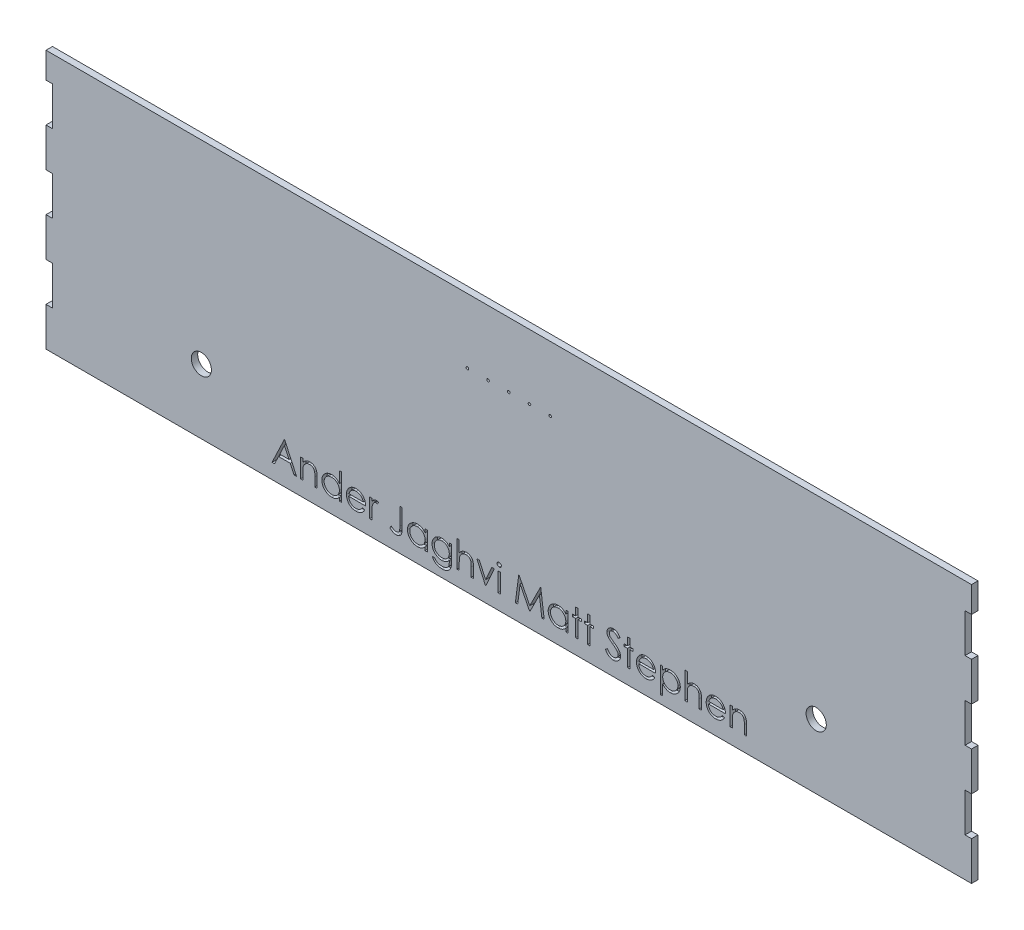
from build123d import *

# Parameters (mm, degrees)
SKETCH1_R           = 0.635
SKETCH1_R_2         = 4.953
BOSS_EXTRUDE1_DEPTH = 3.175
SKETCH3_W           = 1.13974359
SKETCH3_H           = 9.28076923
CUT_EXTRUDE1_DEPTH  = 2.54


with BuildPart() as part:
    # Sketch1 → Boss-Extrude1 (new body)
    with BuildSketch(Plane.XY):
        Polygon((0, 0), (0, 19.05), (3.175, 19.05), (3.175, 38.1), (0, 38.1), (0, 57.15), (3.175, 57.15), (3.175, 76.2), (0, 76.2), (0, 95.25), (3.175, 95.25), (3.175, 114.3), (0, 114.3), (0, 127), (454.025, 127), (454.025, 114.3), (450.85, 114.3), (450.85, 95.25), (454.025, 95.25), (454.025, 76.2), (450.85, 76.2), (450.85, 57.15), (454.025, 57.15), (454.025, 38.1), (450.85, 38.1), (450.85, 19.05), (454.025, 19.05), (454.025, 0), align=None)
        with Locations((227.0125, 95.25)):
            Circle(SKETCH1_R, mode=Mode.SUBTRACT)
        with Locations((237.1725, 95.25)):
            Circle(SKETCH1_R, mode=Mode.SUBTRACT)
        with Locations((247.3325, 95.25)):
            Circle(SKETCH1_R, mode=Mode.SUBTRACT)
        with Locations((216.8525, 95.25)):
            Circle(SKETCH1_R, mode=Mode.SUBTRACT)
        with Locations((206.6925, 95.25)):
            Circle(SKETCH1_R, mode=Mode.SUBTRACT)
        with Locations((76.2, 31.75)):
            Circle(SKETCH1_R_2, mode=Mode.SUBTRACT)
        with Locations(Location((377.825, 31.75, 0), (0, 0, 180))):
            Circle(SKETCH1_R_2, mode=Mode.SUBTRACT)
    extrude(amount=BOSS_EXTRUDE1_DEPTH)

    # Sketch3 → Cut-Extrude1 (cut)
    # profile 1 of 23: a face of its own
    with BuildSketch(Plane.XY.offset(3.175)):
        Polygon((117.074038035, 20.065983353), (122.935576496, 7.365983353), (121.696614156, 7.365983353), (119.819090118, 11.436496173), (114.061858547, 11.436496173), (112.130909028, 7.365983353), (110.886858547, 7.365983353), (116.911217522, 20.065983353), align=None)
        Polygon((116.979907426, 17.590602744), (114.680067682, 12.739060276), (119.218689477, 12.739060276), align=None, mode=Mode.SUBTRACT)
    # profile 2 of 23: a face of its own
    with BuildSketch(Plane.XY.offset(3.175)):
        with BuildLine():
            Line((124.88942265, 16.646752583), (126.02916624, 16.646752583))
            Line((126.02916624, 16.646752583), (126.02916624, 14.972754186))
            add(Edge.make_bspline(
                [(126.02916624, 14.972754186), (126.150859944, 15.124583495), (126.387010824, 15.419213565), (126.780291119, 15.806456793), (127.195921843, 16.125572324), (127.631357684, 16.379948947), (128.087189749, 16.571706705), (128.560639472, 16.710194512), (129.054541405, 16.793233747), (129.390418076, 16.804084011), (129.560336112, 16.809573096)],
                knots=[0, 0, 0, 0, 1.12780773, 2.188550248, 3.19190651, 4.159438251, 5.104880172, 6.052711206, 7.014878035, 8, 8, 8, 8], degree=3))
            add(Edge.make_bspline(
                [(129.560336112, 16.809573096), (129.732078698, 16.80324053), (130.068220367, 16.79084617), (130.557635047, 16.692814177), (131.014738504, 16.525372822), (131.437900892, 16.29600331), (131.819362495, 16.010774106), (132.154369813, 15.678477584), (132.431459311, 15.296258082), (132.617232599, 14.941662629), (132.739608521, 14.627106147), (132.816651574, 14.357696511), (132.882078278, 14.057547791), (132.938799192, 13.727566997), (132.977178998, 13.365442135), (133.007449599, 12.972657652), (133.029143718, 12.549340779), (133.030004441, 12.256563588), (133.030448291, 12.105586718)],
                knots=[0, 0, 0, 0, 1.235846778, 2.418850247, 3.575807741, 4.728682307, 5.871620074, 6.994088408, 8.11269785, 9.256955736, 9.865816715, 10.540099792, 11.271859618, 12.076849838, 12.949306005, 13.892391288, 14.913166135, 16, 16, 16, 16], degree=3))
            Line((133.030448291, 12.105586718), (133.030448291, 7.365983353))
            Line((133.030448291, 7.365983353), (131.890704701, 7.365983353))
            Line((131.890704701, 7.365983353), (131.890704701, 11.731608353))
            add(Edge.make_bspline(
                [(131.890704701, 11.731608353), (131.890003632, 11.857964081), (131.888662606, 12.099661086), (131.884432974, 12.445714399), (131.87423739, 12.759537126), (131.859910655, 13.040379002), (131.83894103, 13.287970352), (131.817087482, 13.502815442), (131.790363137, 13.684641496), (131.766549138, 13.794097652), (131.755868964, 13.843186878)],
                knots=[0, 0, 0, 0, 1.430800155, 2.736877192, 3.918605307, 4.986035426, 5.920637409, 6.731861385, 7.431261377, 8, 8, 8, 8], degree=3))
            add(Edge.make_bspline(
                [(131.755868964, 13.843186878), (131.717313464, 13.987281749), (131.643106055, 14.264619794), (131.459739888, 14.640809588), (131.228185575, 14.960843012), (130.945527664, 15.222741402), (130.614496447, 15.426561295), (130.236010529, 15.567981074), (129.813722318, 15.656432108), (129.516707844, 15.66523913), (129.361898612, 15.669829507)],
                knots=[0, 0, 0, 0, 1.084156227, 2.086665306, 3.027808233, 3.945421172, 4.874247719, 5.839848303, 6.874090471, 8, 8, 8, 8], degree=3))
            add(Edge.make_bspline(
                [(129.361898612, 15.669829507), (129.270213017, 15.66810229), (129.088769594, 15.664684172), (128.819711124, 15.630389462), (128.558729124, 15.574297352), (128.303204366, 15.49857401), (128.058247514, 15.394570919), (127.815988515, 15.276535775), (127.585549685, 15.129403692), (127.362017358, 14.965426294), (127.154053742, 14.783710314), (126.960548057, 14.591960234), (126.788052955, 14.387760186), (126.63177519, 14.174400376), (126.496871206, 13.948950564), (126.379112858, 13.713585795), (126.279197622, 13.467996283), (126.229548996, 13.297543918), (126.204707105, 13.212257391)],
                knots=[0, 0, 0, 0, 1.023777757, 2.026029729, 3.023749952, 4.003683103, 4.997618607, 5.993177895, 7.010360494, 8.046726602, 9.087585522, 10.09234134, 11.086953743, 12.070360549, 13.043493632, 14.017870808, 15.008233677, 16, 16, 16, 16], degree=3))
            add(Edge.make_bspline(
                [(126.204707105, 13.212257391), (126.190411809, 13.149645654), (126.159291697, 13.013343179), (126.125679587, 12.789662), (126.095172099, 12.530908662), (126.069637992, 12.237385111), (126.054015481, 11.908063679), (126.036981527, 11.544350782), (126.030780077, 11.144796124), (126.029719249, 10.866623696), (126.02916624, 10.721612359)],
                knots=[0, 0, 0, 0, 0.615963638, 1.340920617, 2.168419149, 3.115676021, 4.16674242, 5.331190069, 6.6087489, 8, 8, 8, 8], degree=3))
            Line((126.02916624, 10.721612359), (126.02916624, 7.365983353))
            Line((126.02916624, 7.365983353), (124.88942265, 7.365983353))
            Line((124.88942265, 7.365983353), (124.88942265, 16.646752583))
        make_face()
    # profile 3 of 23: a face of its own
    with BuildSketch(Plane.XY.offset(3.175)):
        with BuildLine():
            Line((145.07916624, 20.391624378), (145.07916624, 7.365983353))
            Line((145.07916624, 7.365983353), (143.93942265, 7.365983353))
            Line((143.93942265, 7.365983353), (143.93942265, 8.971291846))
            add(Edge.make_bspline(
                [(143.93942265, 8.971291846), (143.810903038, 8.82600532), (143.5600954, 8.542476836), (143.141209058, 8.172064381), (142.697187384, 7.865891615), (142.230185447, 7.618604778), (141.740624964, 7.432850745), (141.229591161, 7.300820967), (140.696875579, 7.215934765), (140.333102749, 7.207458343), (140.148757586, 7.20316284)],
                knots=[0, 0, 0, 0, 1.074387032, 2.096679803, 3.090159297, 4.057316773, 5.018401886, 5.985159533, 6.978961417, 8, 8, 8, 8], degree=3))
            add(Edge.make_bspline(
                [(140.148757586, 7.20316284), (139.984862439, 7.207612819), (139.661653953, 7.216388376), (139.186205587, 7.284468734), (138.728670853, 7.393799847), (138.288617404, 7.545840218), (137.868892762, 7.747519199), (137.465903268, 7.988968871), (137.081736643, 8.276499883), (136.722248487, 8.605205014), (136.391206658, 8.962238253), (136.100698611, 9.343040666), (135.858480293, 9.745965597), (135.655933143, 10.165911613), (135.499917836, 10.606111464), (135.391156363, 11.065042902), (135.323155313, 11.5421633), (135.314383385, 11.867063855), (135.30993547, 12.031808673)],
                knots=[0, 0, 0, 0, 1.033919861, 2.038935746, 3.024066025, 3.998881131, 4.97069526, 5.957263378, 6.95902576, 7.993208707, 9.027059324, 10.027763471, 11.009749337, 11.988697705, 12.965288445, 13.950418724, 14.960734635, 16, 16, 16, 16], degree=3))
            add(Edge.make_bspline(
                [(135.30993547, 12.031808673), (135.314481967, 12.193148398), (135.323470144, 12.512108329), (135.390428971, 12.981205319), (135.503027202, 13.433028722), (135.661043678, 13.866123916), (135.8636702, 14.281014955), (136.110152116, 14.677995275), (136.400507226, 15.058158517), (136.735251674, 15.41256554), (137.097872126, 15.739937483), (137.485798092, 16.024450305), (137.889379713, 16.270165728), (138.314876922, 16.464851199), (138.755991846, 16.622364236), (139.216651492, 16.731341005), (139.69493922, 16.795557), (140.019661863, 16.804856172), (140.184374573, 16.809573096)],
                knots=[0, 0, 0, 0, 1.020392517, 2.01726096, 2.990465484, 3.961182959, 4.928053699, 5.906110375, 6.912531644, 7.948652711, 8.985773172, 9.998621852, 10.987621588, 11.969261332, 12.953316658, 13.946091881, 14.958173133, 16, 16, 16, 16], degree=3))
            add(Edge.make_bspline(
                [(140.184374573, 16.809573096), (140.37384699, 16.803886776), (140.745760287, 16.792725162), (141.28967778, 16.699447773), (141.804164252, 16.542828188), (142.292181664, 16.328411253), (142.750820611, 16.049734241), (143.183442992, 15.713178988), (143.582525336, 15.309220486), (143.818643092, 15.00582992), (143.93942265, 14.850638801)],
                knots=[0, 0, 0, 0, 1.031072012, 2.023879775, 2.993683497, 3.952812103, 4.918022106, 5.908088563, 6.929940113, 8, 8, 8, 8], degree=3))
            Line((143.93942265, 14.850638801), (143.93942265, 20.391624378))
            Line((143.93942265, 20.391624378), (145.07916624, 20.391624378))
        make_face()
        with BuildLine():
            add(Edge.make_bspline(
                [(140.199638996, 15.669829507), (140.033035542, 15.663901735), (139.704186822, 15.652201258), (139.221427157, 15.560857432), (138.75946134, 15.40887619), (138.320599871, 15.20102472), (137.911775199, 14.939663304), (137.546401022, 14.623537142), (137.221488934, 14.261271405), (136.948227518, 13.85450089), (136.725467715, 13.418426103), (136.568833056, 12.962588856), (136.465530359, 12.495210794), (136.454976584, 12.178209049), (136.44967906, 12.019088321)],
                knots=[0, 0, 0, 0, 1.031046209, 2.035121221, 3.029706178, 4.034933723, 5.034054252, 6.02443088, 7.017295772, 8.038157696, 9.050218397, 10.03989886, 11.016116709, 12, 12, 12, 12], degree=3))
            add(Edge.make_bspline(
                [(136.44967906, 12.019088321), (136.456445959, 11.860918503), (136.469953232, 11.54519884), (136.567020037, 11.077183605), (136.729869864, 10.621238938), (136.952091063, 10.181234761), (137.230353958, 9.772715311), (137.552892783, 9.40354401), (137.922826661, 9.086081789), (138.332592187, 8.820334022), (138.770226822, 8.605658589), (139.230452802, 8.456286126), (139.704618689, 8.35984675), (140.027025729, 8.348581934), (140.189462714, 8.34290643)],
                knots=[0, 0, 0, 0, 0.979072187, 1.954306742, 2.945804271, 3.96968567, 4.997920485, 5.998718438, 6.996577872, 8.005894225, 9.015743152, 10.005417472, 10.995077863, 12, 12, 12, 12], degree=3))
            add(Edge.make_bspline(
                [(140.189462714, 8.34290643), (140.354368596, 8.348929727), (140.682350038, 8.360909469), (141.166541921, 8.452644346), (141.636423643, 8.604205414), (142.085594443, 8.814296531), (142.504027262, 9.074673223), (142.879576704, 9.379498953), (143.197134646, 9.734021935), (143.466347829, 10.123645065), (143.677441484, 10.550771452), (143.831206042, 11.005555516), (143.922115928, 11.488013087), (143.933573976, 11.817719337), (143.93942265, 11.986015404)],
                knots=[0, 0, 0, 0, 1.01762866, 2.023962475, 3.030623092, 4.058876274, 5.077231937, 6.066672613, 7.034107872, 8.005628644, 8.981990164, 9.965428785, 10.961468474, 12, 12, 12, 12], degree=3))
            add(Edge.make_bspline(
                [(143.93942265, 11.986015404), (143.935940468, 12.114241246), (143.929086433, 12.366630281), (143.87672408, 12.737207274), (143.79343049, 13.09184108), (143.676060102, 13.430904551), (143.521877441, 13.752523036), (143.335921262, 14.059005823), (143.114921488, 14.348758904), (142.862435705, 14.617792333), (142.586064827, 14.863179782), (142.293621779, 15.082215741), (141.981641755, 15.262152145), (141.655371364, 15.41107333), (141.314244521, 15.529579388), (140.955485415, 15.608637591), (140.582907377, 15.662922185), (140.328740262, 15.667502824), (140.199638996, 15.669829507)],
                knots=[0, 0, 0, 0, 1.050140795, 2.067009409, 3.05949893, 4.030605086, 5.00011959, 5.97591094, 6.962425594, 7.979863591, 8.993523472, 9.986985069, 10.967611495, 11.937549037, 12.921786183, 13.919465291, 14.943216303, 16, 16, 16, 16], degree=3))
        make_face(mode=Mode.SUBTRACT)
    # profile 4 of 23: a face of its own
    with BuildSketch(Plane.XY.offset(3.175)):
        with BuildLine():
            Line((155.30124156, 10.296752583), (156.313781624, 9.765041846))
            add(Edge.make_bspline(
                [(156.313781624, 9.765041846), (156.23309455, 9.621918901), (156.076109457, 9.343458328), (155.806141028, 8.960891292), (155.523141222, 8.61672958), (155.214335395, 8.320167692), (154.88896256, 8.061626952), (154.545218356, 7.835429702), (154.181313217, 7.642685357), (153.79722993, 7.480297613), (153.389742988, 7.355440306), (152.957864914, 7.267250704), (152.500768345, 7.212737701), (152.187455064, 7.206405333), (152.02702281, 7.20316284)],
                knots=[0, 0, 0, 0, 1.120438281, 2.179929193, 3.190490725, 4.156257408, 5.095198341, 6.022838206, 6.959905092, 7.901321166, 8.864066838, 9.862729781, 10.905609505, 12, 12, 12, 12], degree=3))
            add(Edge.make_bspline(
                [(152.02702281, 7.20316284), (151.848707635, 7.207325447), (151.500866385, 7.215445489), (150.994536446, 7.285449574), (150.517816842, 7.399649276), (150.070734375, 7.559181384), (149.654383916, 7.767560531), (149.267937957, 8.021413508), (148.909364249, 8.31943626), (148.589962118, 8.664210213), (148.30242003, 9.033170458), (148.048689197, 9.417638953), (147.836572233, 9.816648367), (147.66402419, 10.227658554), (147.524669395, 10.648078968), (147.427544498, 11.081734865), (147.371556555, 11.527452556), (147.362976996, 11.828977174), (147.358653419, 11.980927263)],
                knots=[0, 0, 0, 0, 1.145258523, 2.234067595, 3.276747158, 4.290159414, 5.277019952, 6.260822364, 7.254936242, 8.264827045, 9.274100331, 10.257902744, 11.220704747, 12.172965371, 13.118907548, 14.062713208, 15.023725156, 16, 16, 16, 16], degree=3))
            add(Edge.make_bspline(
                [(147.358653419, 11.980927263), (147.362496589, 12.123511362), (147.370113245, 12.406094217), (147.418122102, 12.824343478), (147.503205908, 13.23084672), (147.619959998, 13.625941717), (147.770731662, 14.008966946), (147.955180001, 14.38015552), (148.173592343, 14.739112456), (148.342221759, 14.965546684), (148.427163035, 15.079605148)],
                knots=[0, 0, 0, 0, 1.024358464, 2.0301432, 3.019427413, 4.004406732, 4.986367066, 5.972626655, 6.978780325, 8, 8, 8, 8], degree=3))
            add(Edge.make_bspline(
                [(148.427163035, 15.079605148), (148.542216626, 15.217015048), (148.768679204, 15.487482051), (149.151697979, 15.842858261), (149.566444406, 16.14055996), (150.007720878, 16.387328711), (150.480656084, 16.57483023), (150.978892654, 16.714557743), (151.508103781, 16.792855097), (151.869891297, 16.803914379), (152.055007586, 16.809573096)],
                knots=[0, 0, 0, 0, 1.030682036, 2.02871468, 2.997146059, 3.962720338, 4.930598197, 5.918074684, 6.934738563, 8, 8, 8, 8], degree=3))
            add(Edge.make_bspline(
                [(152.055007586, 16.809573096), (152.245317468, 16.804659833), (152.618662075, 16.795021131), (153.163064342, 16.705662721), (153.678178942, 16.563957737), (154.163799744, 16.363828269), (154.619975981, 16.105620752), (155.043742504, 15.785791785), (155.442346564, 15.41416044), (155.674243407, 15.128362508), (155.792247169, 14.982930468)],
                knots=[0, 0, 0, 0, 1.056321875, 2.072262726, 3.055038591, 4.01806755, 4.982017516, 5.957941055, 6.960871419, 8, 8, 8, 8], degree=3))
            add(Edge.make_bspline(
                [(155.792247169, 14.982930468), (155.872536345, 14.873334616), (156.032580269, 14.654872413), (156.233048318, 14.298651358), (156.407065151, 13.92595863), (156.546159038, 13.530769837), (156.658788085, 13.117767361), (156.740274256, 12.683998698), (156.788061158, 12.22959302), (156.797454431, 11.919979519), (156.802243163, 11.762137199)],
                knots=[0, 0, 0, 0, 0.94817472, 1.890038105, 2.849395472, 3.817997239, 4.812318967, 5.836947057, 6.897266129, 8, 8, 8, 8], degree=3))
            Line((156.802243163, 11.762137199), (148.498397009, 11.762137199))
            add(Edge.make_bspline(
                [(148.498397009, 11.762137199), (148.503983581, 11.639852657), (148.514969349, 11.399385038), (148.566187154, 11.047519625), (148.646918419, 10.712336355), (148.760380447, 10.396349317), (148.897782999, 10.095431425), (149.066096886, 9.811814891), (149.26690041, 9.546791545), (149.490876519, 9.297990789), (149.740185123, 9.076427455), (150.002468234, 8.878119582), (150.281482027, 8.711910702), (150.575026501, 8.577000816), (150.882626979, 8.47138647), (151.204380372, 8.399294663), (151.539653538, 8.351008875), (151.768201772, 8.345639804), (151.884554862, 8.34290643)],
                knots=[0, 0, 0, 0, 1.094153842, 2.151609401, 3.174256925, 4.172055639, 5.149267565, 6.128595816, 7.11444997, 8.118368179, 9.117203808, 10.09244225, 11.054858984, 12.015122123, 12.976791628, 13.957293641, 14.960065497, 16, 16, 16, 16], degree=3))
            add(Edge.make_bspline(
                [(151.884554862, 8.34290643), (151.99831474, 8.345112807), (152.224036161, 8.349490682), (152.560190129, 8.392060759), (152.890896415, 8.460895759), (153.214786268, 8.554839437), (153.525286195, 8.6694183), (153.812834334, 8.807677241), (154.077285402, 8.960620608), (154.32445268, 9.135552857), (154.564195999, 9.349668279), (154.802021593, 9.616860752), (155.057025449, 9.932864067), (155.216644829, 10.170701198), (155.30124156, 10.296752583)],
                knots=[0, 0, 0, 0, 0.99110716, 1.966546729, 2.947904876, 3.932708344, 4.903319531, 5.828989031, 6.710028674, 7.56322171, 8.463672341, 9.504779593, 10.677557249, 12, 12, 12, 12], degree=3))
        make_face()
        with BuildLine():
            add(Edge.make_bspline(
                [(155.662499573, 12.901880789), (155.62078325, 13.053057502), (155.540492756, 13.344024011), (155.372720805, 13.746943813), (155.1837755, 14.105039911), (154.960176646, 14.415571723), (154.706834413, 14.691355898), (154.414207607, 14.932360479), (154.086054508, 15.147960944), (153.724071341, 15.329942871), (153.340742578, 15.484846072), (152.93940011, 15.588714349), (152.529887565, 15.659868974), (152.252903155, 15.666495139), (152.113521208, 15.669829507)],
                knots=[0, 0, 0, 0, 1.154881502, 2.222775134, 3.210006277, 4.132804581, 5.035138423, 5.962687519, 6.919655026, 7.923214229, 8.944639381, 9.960483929, 10.97369054, 12, 12, 12, 12], degree=3))
            add(Edge.make_bspline(
                [(152.113521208, 15.669829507), (151.999767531, 15.667610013), (151.774900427, 15.66322254), (151.44360798, 15.621602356), (151.125455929, 15.552805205), (150.818096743, 15.458589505), (150.525558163, 15.333009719), (150.241822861, 15.185750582), (149.974105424, 15.005985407), (149.806678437, 14.868974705), (149.722094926, 14.799757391)],
                knots=[0, 0, 0, 0, 1.04873581, 2.073130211, 3.073294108, 4.04793562, 5.032784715, 6.005352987, 6.992311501, 8, 8, 8, 8], degree=3))
            add(Edge.make_bspline(
                [(149.722094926, 14.799757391), (149.66152216, 14.744986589), (149.538937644, 14.634143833), (149.375142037, 14.443174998), (149.218313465, 14.237247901), (149.075588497, 14.008484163), (148.944678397, 13.759488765), (148.822177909, 13.492361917), (148.711918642, 13.205076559), (148.649884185, 13.004879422), (148.617968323, 12.901880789)],
                knots=[0, 0, 0, 0, 0.879870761, 1.780643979, 2.707998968, 3.669668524, 4.684282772, 5.740141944, 6.837334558, 8, 8, 8, 8], degree=3))
            Line((148.617968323, 12.901880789), (155.662499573, 12.901880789))
        make_face(mode=Mode.SUBTRACT)
    # profile 5 of 23: a face of its own
    with BuildSketch(Plane.XY.offset(3.175)):
        with BuildLine():
            Line((158.756089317, 16.646752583), (159.895832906, 16.646752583))
            Line((159.895832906, 16.646752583), (159.895832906, 15.280586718))
            add(Edge.make_bspline(
                [(159.895832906, 15.280586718), (159.979974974, 15.407789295), (160.140896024, 15.651063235), (160.408368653, 15.972806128), (160.682337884, 16.239197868), (160.964115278, 16.451482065), (161.255772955, 16.610461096), (161.550909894, 16.726912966), (161.854169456, 16.79577351), (162.05795701, 16.804967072), (162.160055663, 16.809573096)],
                knots=[0, 0, 0, 0, 1.2804753, 2.448899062, 3.506932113, 4.484331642, 5.4025378, 6.288909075, 7.142734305, 8, 8, 8, 8], degree=3))
            add(Edge.make_bspline(
                [(162.160055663, 16.809573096), (162.239254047, 16.805253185), (162.402209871, 16.796364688), (162.648889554, 16.733913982), (162.903047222, 16.634208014), (163.066849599, 16.540444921), (163.152243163, 16.491564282)],
                knots=[0, 0, 0, 0, 0.901110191, 1.854092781, 2.881294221, 4, 4, 4, 4], degree=3))
            Line((163.152243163, 16.491564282), (162.526401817, 15.504464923))
            add(Edge.make_bspline(
                [(162.526401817, 15.504464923), (162.471577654, 15.52892246), (162.367510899, 15.575347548), (162.215275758, 15.630291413), (162.074917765, 15.66264345), (161.985496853, 15.667544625), (161.943809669, 15.669829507)],
                knots=[0, 0, 0, 0, 1.180555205, 2.24091978, 3.179933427, 4, 4, 4, 4], degree=3))
            add(Edge.make_bspline(
                [(161.943809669, 15.669829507), (161.852348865, 15.663733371), (161.665795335, 15.651299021), (161.391894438, 15.553549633), (161.12611172, 15.395615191), (160.915031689, 15.220460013), (160.751592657, 15.051558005), (160.634969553, 14.904062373), (160.527989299, 14.738677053), (160.425771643, 14.558229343), (160.332639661, 14.359638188), (160.245718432, 14.14488767), (160.167127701, 13.91372906), (160.122313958, 13.752683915), (160.099358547, 13.670190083)],
                knots=[0, 0, 0, 0, 1.125678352, 2.296057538, 3.5422874, 4.923748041, 5.663163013, 6.437101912, 7.23742474, 8.08941207, 8.991984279, 9.93940061, 10.944477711, 12, 12, 12, 12], degree=3))
            add(Edge.make_bspline(
                [(160.099358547, 13.670190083), (160.08218672, 13.596612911), (160.044152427, 13.433645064), (160.007171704, 13.16023756), (159.970633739, 12.837208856), (159.944883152, 12.46365979), (159.921014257, 12.040523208), (159.907551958, 11.567154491), (159.896291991, 11.043067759), (159.895990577, 10.676675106), (159.895832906, 10.485013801)],
                knots=[0, 0, 0, 0, 0.566838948, 1.255505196, 2.06880316, 3.007127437, 4.065329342, 5.249902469, 6.561414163, 8, 8, 8, 8], degree=3))
            Line((159.895832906, 10.485013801), (159.895832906, 7.365983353))
            Line((159.895832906, 7.365983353), (158.756089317, 7.365983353))
            Line((158.756089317, 7.365983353), (158.756089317, 16.646752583))
        make_face()
    # profile 6 of 23: a face of its own
    with BuildSketch(Plane.XY.offset(3.175)):
        with BuildLine():
            Line((173.572755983, 20.065983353), (174.712499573, 20.065983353))
            Line((174.712499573, 20.065983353), (174.712499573, 11.489921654))
            add(Edge.make_bspline(
                [(174.712499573, 11.489921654), (174.711360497, 11.33133432), (174.709173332, 11.026827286), (174.697146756, 10.588227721), (174.674890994, 10.187739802), (174.642469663, 9.824452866), (174.599216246, 9.499505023), (174.549718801, 9.210385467), (174.489800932, 8.959507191), (174.399571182, 8.677801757), (174.251619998, 8.36885138), (174.028945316, 8.035185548), (173.752329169, 7.743327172), (173.431922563, 7.48986157), (173.064925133, 7.287905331), (172.658894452, 7.142925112), (172.216329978, 7.054493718), (171.909355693, 7.04515412), (171.751201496, 7.040342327)],
                knots=[0, 0, 0, 0, 1.237770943, 2.376671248, 3.424123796, 4.367912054, 5.222547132, 5.982086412, 6.656319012, 7.234008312, 8.288027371, 9.317870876, 10.352700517, 11.413286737, 12.494591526, 13.606319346, 14.766767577, 16, 16, 16, 16], degree=3))
            add(Edge.make_bspline(
                [(171.751201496, 7.040342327), (171.627981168, 7.044263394), (171.380053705, 7.052152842), (171.011061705, 7.116457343), (170.643117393, 7.215575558), (170.27426785, 7.360727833), (169.897225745, 7.558142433), (169.506884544, 7.816441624), (169.098223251, 8.135144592), (168.829043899, 8.37839584), (168.688140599, 8.505726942)],
                knots=[0, 0, 0, 0, 0.848567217, 1.707373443, 2.573483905, 3.470863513, 4.432650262, 5.500696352, 6.691726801, 8, 8, 8, 8], degree=3))
            Line((168.688140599, 8.505726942), (169.359775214, 9.482650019))
            add(Edge.make_bspline(
                [(169.359775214, 9.482650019), (169.514724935, 9.375798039), (169.807290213, 9.174047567), (170.237292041, 8.914508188), (170.61828171, 8.691985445), (170.867502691, 8.578584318), (170.982892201, 8.526079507)],
                knots=[0, 0, 0, 0, 1.196737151, 2.259595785, 3.194191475, 4, 4, 4, 4], degree=3))
            add(Edge.make_bspline(
                [(170.982892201, 8.526079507), (171.052866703, 8.498649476), (171.190102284, 8.444853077), (171.399924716, 8.384815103), (171.608549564, 8.352004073), (171.746862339, 8.345903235), (171.814803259, 8.34290643)],
                knots=[0, 0, 0, 0, 1.051806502, 2.062826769, 3.048436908, 4, 4, 4, 4], degree=3))
            add(Edge.make_bspline(
                [(171.814803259, 8.34290643), (171.902552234, 8.346617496), (172.075999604, 8.353952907), (172.328054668, 8.418720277), (172.569202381, 8.51757854), (172.790797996, 8.662326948), (172.995033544, 8.834435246), (173.163554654, 9.042555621), (173.304042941, 9.273209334), (173.388587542, 9.491545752), (173.442452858, 9.690669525), (173.476639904, 9.873669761), (173.506534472, 10.087615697), (173.532593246, 10.33276271), (173.547849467, 10.609601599), (173.564966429, 10.917319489), (173.57115409, 11.256692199), (173.572205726, 11.493314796), (173.572755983, 11.61712518)],
                knots=[0, 0, 0, 0, 0.997221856, 1.971139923, 2.944579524, 3.951425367, 4.971190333, 5.972282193, 6.985401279, 8.033996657, 8.624075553, 9.332086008, 10.151144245, 11.082816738, 12.137127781, 13.306538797, 14.590673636, 16, 16, 16, 16], degree=3))
            Line((173.572755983, 11.61712518), (173.572755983, 20.065983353))
        make_face()
    # profile 7 of 23: a face of its own
    with BuildSketch(Plane.XY.offset(3.175)):
        with BuildLine():
            Line((187.086858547, 16.646752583), (187.086858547, 7.365983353))
            Line((187.086858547, 7.365983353), (185.947114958, 7.365983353))
            Line((185.947114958, 7.365983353), (185.947114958, 8.971291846))
            add(Edge.make_bspline(
                [(185.947114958, 8.971291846), (185.818595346, 8.82600532), (185.567787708, 8.542476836), (185.148901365, 8.172064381), (184.704879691, 7.865891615), (184.237877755, 7.618604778), (183.748317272, 7.432850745), (183.237283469, 7.300820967), (182.704567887, 7.215934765), (182.340795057, 7.207458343), (182.156449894, 7.20316284)],
                knots=[0, 0, 0, 0, 1.074387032, 2.096679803, 3.090159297, 4.057316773, 5.018401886, 5.985159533, 6.978961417, 8, 8, 8, 8], degree=3))
            add(Edge.make_bspline(
                [(182.156449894, 7.20316284), (181.992554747, 7.207612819), (181.66934626, 7.216388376), (181.193897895, 7.284468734), (180.736363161, 7.393799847), (180.296309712, 7.545840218), (179.87658507, 7.747519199), (179.473595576, 7.988968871), (179.089428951, 8.276499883), (178.729940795, 8.605205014), (178.398898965, 8.962238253), (178.108390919, 9.343040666), (177.8661726, 9.745965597), (177.66362545, 10.165911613), (177.507610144, 10.606111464), (177.398848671, 11.065042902), (177.330847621, 11.5421633), (177.322075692, 11.867063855), (177.317627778, 12.031808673)],
                knots=[0, 0, 0, 0, 1.033919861, 2.038935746, 3.024066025, 3.998881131, 4.97069526, 5.957263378, 6.95902576, 7.993208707, 9.027059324, 10.027763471, 11.009749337, 11.988697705, 12.965288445, 13.950418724, 14.960734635, 16, 16, 16, 16], degree=3))
            add(Edge.make_bspline(
                [(177.317627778, 12.031808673), (177.322174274, 12.193148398), (177.331162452, 12.512108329), (177.398121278, 12.981205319), (177.51071951, 13.433028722), (177.668735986, 13.866123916), (177.871362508, 14.281014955), (178.117844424, 14.677995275), (178.408199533, 15.058158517), (178.742943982, 15.41256554), (179.105564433, 15.739937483), (179.4934904, 16.024450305), (179.897072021, 16.270165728), (180.32256923, 16.464851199), (180.763684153, 16.622364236), (181.224343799, 16.731341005), (181.702631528, 16.795557), (182.02735417, 16.804856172), (182.192066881, 16.809573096)],
                knots=[0, 0, 0, 0, 1.020392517, 2.01726096, 2.990465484, 3.961182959, 4.928053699, 5.906110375, 6.912531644, 7.948652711, 8.985773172, 9.998621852, 10.987621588, 11.969261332, 12.953316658, 13.946091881, 14.958173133, 16, 16, 16, 16], degree=3))
            add(Edge.make_bspline(
                [(182.192066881, 16.809573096), (182.381477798, 16.804356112), (182.752903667, 16.794125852), (183.296202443, 16.70898967), (183.810169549, 16.565158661), (184.298772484, 16.369515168), (184.760256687, 16.109532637), (185.19025323, 15.781582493), (185.59326227, 15.387733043), (185.826870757, 15.08521743), (185.947114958, 14.929504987)],
                knots=[0, 0, 0, 0, 1.038897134, 2.037228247, 3.008116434, 3.962042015, 4.918381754, 5.904844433, 6.921570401, 8, 8, 8, 8], degree=3))
            Line((185.947114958, 14.929504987), (185.947114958, 16.646752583))
            Line((185.947114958, 16.646752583), (187.086858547, 16.646752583))
        make_face()
        with BuildLine():
            add(Edge.make_bspline(
                [(182.207331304, 15.669829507), (182.040727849, 15.663901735), (181.711879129, 15.652201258), (181.229119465, 15.560857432), (180.767153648, 15.40887619), (180.328292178, 15.20102472), (179.919467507, 14.939663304), (179.55409333, 14.623537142), (179.229181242, 14.261271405), (178.955919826, 13.85450089), (178.733160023, 13.418426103), (178.576525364, 12.962588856), (178.473222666, 12.495210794), (178.462668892, 12.178209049), (178.457371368, 12.019088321)],
                knots=[0, 0, 0, 0, 1.031046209, 2.035121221, 3.029706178, 4.034933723, 5.034054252, 6.02443088, 7.017295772, 8.038157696, 9.050218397, 10.03989886, 11.016116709, 12, 12, 12, 12], degree=3))
            add(Edge.make_bspline(
                [(178.457371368, 12.019088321), (178.464138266, 11.860918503), (178.47764554, 11.54519884), (178.574712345, 11.077183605), (178.737562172, 10.621238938), (178.959783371, 10.181234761), (179.238046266, 9.772715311), (179.560585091, 9.40354401), (179.930518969, 9.086081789), (180.340284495, 8.820334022), (180.77791913, 8.605658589), (181.23814511, 8.456286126), (181.712310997, 8.35984675), (182.034718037, 8.348581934), (182.197155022, 8.34290643)],
                knots=[0, 0, 0, 0, 0.979072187, 1.954306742, 2.945804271, 3.96968567, 4.997920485, 5.998718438, 6.996577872, 8.005894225, 9.015743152, 10.005417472, 10.995077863, 12, 12, 12, 12], degree=3))
            add(Edge.make_bspline(
                [(182.197155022, 8.34290643), (182.362060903, 8.348929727), (182.690042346, 8.360909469), (183.174234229, 8.452644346), (183.644115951, 8.604205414), (184.093286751, 8.814296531), (184.51171957, 9.074673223), (184.887269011, 9.379498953), (185.204826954, 9.734021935), (185.474040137, 10.123645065), (185.685133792, 10.550771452), (185.83889835, 11.005555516), (185.929808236, 11.488013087), (185.941266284, 11.817719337), (185.947114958, 11.986015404)],
                knots=[0, 0, 0, 0, 1.01762866, 2.023962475, 3.030623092, 4.058876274, 5.077231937, 6.066672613, 7.034107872, 8.005628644, 8.981990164, 9.965428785, 10.961468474, 12, 12, 12, 12], degree=3))
            add(Edge.make_bspline(
                [(185.947114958, 11.986015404), (185.943632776, 12.114241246), (185.93677874, 12.366630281), (185.884416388, 12.737207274), (185.801122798, 13.09184108), (185.68375241, 13.430904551), (185.529569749, 13.752523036), (185.34361357, 14.059005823), (185.122613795, 14.348758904), (184.870128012, 14.617792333), (184.593757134, 14.863179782), (184.301314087, 15.082215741), (183.989334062, 15.262152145), (183.663063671, 15.41107333), (183.321936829, 15.529579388), (182.963177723, 15.608637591), (182.590599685, 15.662922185), (182.336432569, 15.667502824), (182.207331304, 15.669829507)],
                knots=[0, 0, 0, 0, 1.050140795, 2.067009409, 3.05949893, 4.030605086, 5.00011959, 5.97591094, 6.962425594, 7.979863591, 8.993523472, 9.986985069, 10.967611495, 11.937549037, 12.921786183, 13.919465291, 14.943216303, 16, 16, 16, 16], degree=3))
        make_face(mode=Mode.SUBTRACT)
    # profile 8 of 23: a face of its own
    with BuildSketch(Plane.XY.offset(3.175)):
        with BuildLine():
            Line((197.833012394, 16.646752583), (198.972755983, 16.646752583))
            Line((198.972755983, 16.646752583), (198.972755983, 9.281668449))
            add(Edge.make_bspline(
                [(198.972755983, 9.281668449), (198.971750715, 9.124777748), (198.969810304, 8.821940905), (198.955836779, 8.384051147), (198.926370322, 7.979588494), (198.892955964, 7.606708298), (198.844889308, 7.267138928), (198.786192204, 6.959867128), (198.720022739, 6.68459803), (198.661892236, 6.515053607), (198.634394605, 6.434853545)],
                knots=[0, 0, 0, 0, 1.307562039, 2.523909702, 3.650326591, 4.686913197, 5.643429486, 6.506965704, 7.293745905, 8, 8, 8, 8], degree=3))
            add(Edge.make_bspline(
                [(198.634394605, 6.434853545), (198.593793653, 6.330604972), (198.513805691, 6.125224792), (198.363997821, 5.834088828), (198.1962348, 5.559963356), (198.004621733, 5.304376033), (197.790025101, 5.068609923), (197.55750083, 4.84754284), (197.302520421, 4.645851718), (197.025229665, 4.467016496), (196.732020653, 4.305954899), (196.42306194, 4.166448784), (196.100095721, 4.04493938), (195.760088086, 3.953924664), (195.408369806, 3.875058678), (195.040804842, 3.823733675), (194.659540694, 3.788801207), (194.400296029, 3.785570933), (194.268769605, 3.783932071)],
                knots=[0, 0, 0, 0, 0.981931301, 1.934503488, 2.87077864, 3.801706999, 4.735015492, 5.667491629, 6.616593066, 7.585388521, 8.561939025, 9.551802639, 10.560317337, 11.588439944, 12.640189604, 13.723962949, 14.845264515, 16, 16, 16, 16], degree=3))
            add(Edge.make_bspline(
                [(194.268769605, 3.783932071), (194.076873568, 3.787039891), (193.702049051, 3.793110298), (193.155568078, 3.863834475), (192.63655638, 3.963817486), (192.151871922, 4.115148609), (191.704577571, 4.300339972), (191.29772808, 4.512955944), (190.934975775, 4.756757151), (190.60795559, 5.034345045), (190.312801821, 5.364413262), (190.035117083, 5.753391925), (189.767833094, 6.207206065), (189.611192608, 6.540282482), (189.52916624, 6.714701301)],
                knots=[0, 0, 0, 0, 1.157897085, 2.2616841, 3.32207898, 4.345638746, 5.321241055, 6.241986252, 7.112515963, 7.955008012, 8.825025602, 9.77857164, 10.836726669, 12, 12, 12, 12], degree=3))
            Line((189.52916624, 6.714701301), (190.668909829, 6.714701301))
            add(Edge.make_bspline(
                [(190.668909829, 6.714701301), (190.76057556, 6.569174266), (190.939770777, 6.284686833), (191.274863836, 5.916339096), (191.64209822, 5.601548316), (192.053867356, 5.347872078), (192.511884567, 5.156610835), (193.016425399, 5.020266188), (193.571595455, 4.938636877), (193.958104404, 4.928798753), (194.159374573, 4.92367566)],
                knots=[0, 0, 0, 0, 0.997731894, 1.950442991, 2.880492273, 3.800895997, 4.748200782, 5.754801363, 6.83083817, 8, 8, 8, 8], degree=3))
            add(Edge.make_bspline(
                [(194.159374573, 4.92367566), (194.358100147, 4.928865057), (194.741223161, 4.938869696), (195.292153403, 5.020302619), (195.795055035, 5.156640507), (196.24703062, 5.347533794), (196.642747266, 5.581396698), (196.983876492, 5.842654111), (197.260172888, 6.137225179), (197.446002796, 6.408576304), (197.561516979, 6.650326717), (197.635076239, 6.858434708), (197.694853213, 7.093758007), (197.744854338, 7.355507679), (197.78611451, 7.644057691), (197.812250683, 7.960067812), (197.831140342, 8.302819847), (197.832373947, 8.540466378), (197.833012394, 8.663459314)],
                knots=[0, 0, 0, 0, 1.570740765, 3.028230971, 4.391408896, 5.680370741, 6.894727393, 8.017376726, 9.065722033, 10.075533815, 10.603371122, 11.180248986, 11.817768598, 12.521299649, 13.286540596, 14.121245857, 15.027658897, 16, 16, 16, 16], degree=3))
            Line((197.833012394, 8.663459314), (197.833012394, 9.144288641))
            add(Edge.make_bspline(
                [(197.833012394, 9.144288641), (197.717329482, 9.006614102), (197.487998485, 8.733686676), (197.091949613, 8.376048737), (196.659362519, 8.06803335), (196.190973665, 7.815417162), (195.698256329, 7.613373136), (195.186547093, 7.472065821), (194.660433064, 7.380771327), (194.30391812, 7.370947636), (194.123757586, 7.365983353)],
                knots=[0, 0, 0, 0, 1.012485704, 2.007162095, 2.997754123, 3.998611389, 4.999708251, 5.992315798, 6.98544096, 8, 8, 8, 8], degree=3))
            add(Edge.make_bspline(
                [(194.123757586, 7.365983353), (194.017671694, 7.367852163), (193.806755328, 7.371567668), (193.493410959, 7.404075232), (193.184690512, 7.451242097), (192.881313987, 7.520480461), (192.58284362, 7.60935044), (192.289772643, 7.720445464), (191.999728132, 7.846048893), (191.717982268, 7.993995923), (191.447341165, 8.158596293), (191.189846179, 8.336900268), (190.946846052, 8.527974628), (190.720653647, 8.733703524), (190.511565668, 8.9537892), (190.316769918, 9.185885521), (190.139487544, 9.433233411), (189.976080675, 9.691322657), (189.834357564, 9.961872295), (189.709954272, 10.23901567), (189.601788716, 10.52216019), (189.515554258, 10.812253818), (189.449691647, 11.109113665), (189.400668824, 11.412253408), (189.372863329, 11.722606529), (189.368527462, 11.93168971), (189.366345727, 12.036896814)],
                knots=[0, 0, 0, 0, 1.028754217, 2.045334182, 3.052854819, 4.056607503, 5.061168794, 6.071104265, 7.095078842, 8.125279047, 9.155117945, 10.165957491, 11.161587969, 12.151493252, 13.128948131, 14.104219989, 15.088194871, 16.07871515, 17.064853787, 18.047899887, 19.02414258, 20.002704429, 20.980574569, 21.971845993, 22.979467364, 24, 24, 24, 24], degree=3))
            add(Edge.make_bspline(
                [(189.366345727, 12.036896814), (189.368229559, 12.14213662), (189.371989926, 12.352208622), (189.404469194, 12.663828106), (189.450799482, 12.971274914), (189.524124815, 13.271380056), (189.612380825, 13.567561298), (189.72168636, 13.857630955), (189.853108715, 14.141677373), (190.001915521, 14.419910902), (190.169134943, 14.688597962), (190.352495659, 14.94378322), (190.552219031, 15.183588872), (190.765549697, 15.410434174), (190.995092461, 15.62213045), (191.240728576, 15.818163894), (191.500036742, 16.001820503), (191.77382062, 16.169138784), (192.057855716, 16.317120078), (192.344925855, 16.452148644), (192.638833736, 16.559315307), (192.934099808, 16.65374198), (193.23592407, 16.720635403), (193.540605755, 16.772241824), (193.849187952, 16.803682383), (194.0558456, 16.807606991), (194.159374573, 16.809573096)],
                knots=[0, 0, 0, 0, 1.008818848, 2.013730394, 3.001654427, 3.987803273, 4.973046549, 5.963777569, 6.957074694, 7.972068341, 8.987420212, 9.989399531, 10.982630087, 11.977756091, 12.973280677, 13.973972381, 14.989194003, 16.018387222, 17.047741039, 18.059210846, 19.057554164, 20.045176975, 21.029480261, 22.018708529, 23.007435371, 24, 24, 24, 24], degree=3))
            add(Edge.make_bspline(
                [(194.159374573, 16.809573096), (194.330102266, 16.80465031), (194.667237, 16.794929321), (195.163375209, 16.718652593), (195.642137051, 16.597044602), (196.106224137, 16.422816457), (196.559416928, 16.184963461), (197.000221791, 15.871661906), (197.429914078, 15.480101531), (197.695082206, 15.179826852), (197.833012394, 15.023635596)],
                knots=[0, 0, 0, 0, 0.96728863, 1.910097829, 2.838038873, 3.762875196, 4.71315279, 5.730631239, 6.819562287, 8, 8, 8, 8], degree=3))
            Line((197.833012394, 15.023635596), (197.833012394, 16.646752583))
        make_face()
        with BuildLine():
            add(Edge.make_bspline(
                [(194.250961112, 15.669829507), (194.084298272, 15.664165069), (193.754341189, 15.652950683), (193.270694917, 15.557211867), (192.803781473, 15.407185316), (192.362527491, 15.192582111), (191.949207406, 14.930983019), (191.582450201, 14.614062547), (191.261666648, 14.252126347), (190.990311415, 13.848446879), (190.774297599, 13.41293748), (190.621377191, 12.953884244), (190.522498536, 12.478704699), (190.511585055, 12.154409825), (190.506089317, 11.991103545)],
                knots=[0, 0, 0, 0, 1.026226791, 2.031711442, 3.026614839, 4.04107745, 5.047145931, 6.032893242, 7.017642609, 8.019221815, 9.021877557, 10.003543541, 10.994637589, 12, 12, 12, 12], degree=3))
            add(Edge.make_bspline(
                [(190.506089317, 11.991103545), (190.508722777, 11.867974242), (190.513902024, 11.625814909), (190.563699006, 11.270440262), (190.644184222, 10.931965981), (190.758256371, 10.610371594), (190.899599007, 10.303812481), (191.077371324, 10.014400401), (191.286561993, 9.74187761), (191.525533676, 9.488259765), (191.788882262, 9.257261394), (192.074520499, 9.054286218), (192.382060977, 8.888276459), (192.703939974, 8.744799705), (193.047967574, 8.640009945), (193.409188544, 8.560040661), (193.790158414, 8.514288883), (194.049861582, 8.50861816), (194.182271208, 8.505726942)],
                knots=[0, 0, 0, 0, 1.039728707, 2.044842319, 3.024901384, 3.974314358, 4.923051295, 5.871625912, 6.837440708, 7.820715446, 8.810779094, 9.792721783, 10.773906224, 11.758876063, 12.764959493, 13.806266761, 14.881525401, 16, 16, 16, 16], degree=3))
            add(Edge.make_bspline(
                [(194.182271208, 8.505726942), (194.316396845, 8.508512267), (194.578678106, 8.513958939), (194.96174979, 8.560780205), (195.324725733, 8.636334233), (195.667273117, 8.743605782), (195.990685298, 8.880481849), (196.291329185, 9.053697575), (196.575651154, 9.2509628), (196.834572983, 9.481057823), (197.068703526, 9.734640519), (197.27274088, 10.010574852), (197.446601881, 10.304708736), (197.59057514, 10.617009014), (197.700488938, 10.949902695), (197.774217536, 11.302557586), (197.825767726, 11.673284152), (197.830560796, 11.927315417), (197.833012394, 12.057249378)],
                knots=[0, 0, 0, 0, 1.121943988, 2.193949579, 3.223793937, 4.220241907, 5.192961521, 6.155822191, 7.11847367, 8.083710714, 9.04790392, 10.001595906, 10.949595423, 11.902125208, 12.873731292, 13.87582262, 14.913508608, 16, 16, 16, 16], degree=3))
            add(Edge.make_bspline(
                [(197.833012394, 12.057249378), (197.828151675, 12.226405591), (197.818655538, 12.556877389), (197.729040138, 13.038413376), (197.584549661, 13.491145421), (197.381905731, 13.913641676), (197.127971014, 14.301425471), (196.822115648, 14.647314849), (196.469614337, 14.9517551), (196.071479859, 15.205385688), (195.643136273, 15.41027455), (195.19493079, 15.563987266), (194.727528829, 15.651052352), (194.410731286, 15.663534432), (194.250961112, 15.669829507)],
                knots=[0, 0, 0, 0, 1.070913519, 2.092188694, 3.091357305, 4.074328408, 5.051968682, 6.018948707, 6.99050112, 7.9935919, 9.000589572, 9.992915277, 10.987769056, 12, 12, 12, 12], degree=3))
        make_face(mode=Mode.SUBTRACT)
    # profile 9 of 23: a face of its own
    with BuildSketch(Plane.XY.offset(3.175)):
        with BuildLine():
            Line((201.577884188, 20.391624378), (202.717627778, 20.391624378))
            Line((202.717627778, 20.391624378), (202.717627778, 14.893888))
            add(Edge.make_bspline(
                [(202.717627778, 14.893888), (202.839973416, 15.046810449), (203.078186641, 15.344558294), (203.479129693, 15.733037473), (203.890866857, 16.069763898), (204.327619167, 16.337808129), (204.781373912, 16.549559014), (205.254044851, 16.699737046), (205.745719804, 16.792088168), (206.079639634, 16.803693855), (206.24879765, 16.809573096)],
                knots=[0, 0, 0, 0, 1.125788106, 2.19196713, 3.20547328, 4.180437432, 5.132270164, 6.079753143, 7.027236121, 8, 8, 8, 8], degree=3))
            add(Edge.make_bspline(
                [(206.24879765, 16.809573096), (206.420539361, 16.803239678), (206.756679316, 16.79084365), (207.246106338, 16.692823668), (207.70316437, 16.525338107), (208.126494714, 16.296132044), (208.506858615, 16.010662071), (208.843770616, 15.681073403), (209.118964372, 15.299079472), (209.306195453, 14.946178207), (209.428018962, 14.632166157), (209.505132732, 14.36279367), (209.57051668, 14.062631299), (209.627484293, 13.731833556), (209.665452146, 13.368812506), (209.695948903, 12.975205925), (209.717634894, 12.551036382), (209.718475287, 12.257411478), (209.718909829, 12.105586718)],
                knots=[0, 0, 0, 0, 1.235656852, 2.418478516, 3.575258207, 4.727955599, 5.870717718, 6.98870536, 8.107142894, 9.245821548, 9.854588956, 10.528768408, 11.260415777, 12.065282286, 12.943670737, 13.886611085, 14.907229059, 16, 16, 16, 16], degree=3))
            Line((209.718909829, 12.105586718), (209.718909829, 7.365983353))
            Line((209.718909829, 7.365983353), (208.57916624, 7.365983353))
            Line((208.57916624, 7.365983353), (208.57916624, 11.731608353))
            add(Edge.make_bspline(
                [(208.57916624, 11.731608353), (208.578475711, 11.857964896), (208.577154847, 12.09966346), (208.572788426, 12.445706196), (208.563041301, 12.759563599), (208.547290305, 13.040229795), (208.530724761, 13.28809607), (208.507925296, 13.502802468), (208.481399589, 13.684643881), (208.457564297, 13.79409839), (208.446874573, 13.843186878)],
                knots=[0, 0, 0, 0, 1.430932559, 2.737130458, 3.918967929, 4.986496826, 5.920444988, 6.731744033, 7.431208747, 8, 8, 8, 8], degree=3))
            add(Edge.make_bspline(
                [(208.446874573, 13.843186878), (208.405420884, 13.987220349), (208.325726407, 14.264123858), (208.140495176, 14.640270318), (207.90914105, 14.960980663), (207.626666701, 15.221926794), (207.298069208, 15.426620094), (206.92120591, 15.568380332), (206.499623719, 15.656364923), (206.202619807, 15.66521611), (206.047816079, 15.669829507)],
                knots=[0, 0, 0, 0, 1.090059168, 2.095632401, 3.037101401, 3.955032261, 4.878929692, 5.839099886, 6.873700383, 8, 8, 8, 8], degree=3))
            add(Edge.make_bspline(
                [(206.047816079, 15.669829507), (205.95613016, 15.668102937), (205.774686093, 15.6646861), (205.505632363, 15.630381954), (205.244632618, 15.574325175), (204.989173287, 15.498471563), (204.744668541, 15.395254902), (204.503991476, 15.275765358), (204.273961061, 15.129503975), (204.050492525, 14.965399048), (203.842511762, 14.783717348), (203.649010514, 14.591958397), (203.476514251, 14.38776067), (203.320236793, 14.174400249), (203.185332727, 13.948950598), (203.067574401, 13.713585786), (202.96765916, 13.467996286), (202.918010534, 13.297543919), (202.893168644, 13.212257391)],
                knots=[0, 0, 0, 0, 1.024319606, 2.027102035, 3.025350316, 4.005802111, 5.00026367, 5.987881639, 7.005602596, 8.042517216, 9.083927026, 10.089214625, 11.084353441, 12.06828073, 13.041928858, 14.016821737, 15.00770877, 16, 16, 16, 16], degree=3))
            add(Edge.make_bspline(
                [(202.893168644, 13.212257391), (202.87887415, 13.150495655), (202.847724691, 13.01590923), (202.813925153, 12.793933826), (202.783670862, 12.535991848), (202.758094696, 12.242474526), (202.742408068, 11.912306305), (202.725505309, 11.547740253), (202.719213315, 11.146492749), (202.718172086, 10.867471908), (202.717627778, 10.721612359)],
                knots=[0, 0, 0, 0, 0.607992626, 1.324890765, 2.152360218, 3.099583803, 4.150613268, 5.323148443, 6.60066238, 8, 8, 8, 8], degree=3))
            Line((202.717627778, 10.721612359), (202.717627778, 7.365983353))
            Line((202.717627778, 7.365983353), (201.577884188, 7.365983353))
            Line((201.577884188, 7.365983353), (201.577884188, 20.391624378))
        make_face()
    # profile 10 of 23: a face of its own
    with BuildSketch(Plane.XY.offset(3.175)):
        Polygon((211.347114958, 16.646752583), (212.580989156, 16.646752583), (215.661858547, 9.889701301), (218.742727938, 16.646752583), (219.976602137, 16.646752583), (215.743268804, 7.365983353), (215.580448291, 7.365983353), align=None)
    # profile 11 of 23: a face of its own
    with BuildSketch(Plane.XY.offset(3.175)):
        with BuildLine():
            add(Edge.make_bspline(
                [(222.332411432, 20.554444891), (222.403137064, 20.55116411), (222.541631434, 20.544739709), (222.741904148, 20.489725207), (222.924265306, 20.396472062), (223.086018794, 20.271360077), (223.224818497, 20.124223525), (223.321994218, 19.952733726), (223.384450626, 19.767463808), (223.391992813, 19.638231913), (223.395832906, 19.572433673)],
                knots=[0, 0, 0, 0, 1.055194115, 2.066272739, 3.074728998, 4.095836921, 5.109056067, 6.073838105, 7.019297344, 8, 8, 8, 8], degree=3))
            add(Edge.make_bspline(
                [(223.395832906, 19.572433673), (223.391906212, 19.508343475), (223.384143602, 19.381644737), (223.322042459, 19.199586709), (223.223990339, 19.030479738), (223.086107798, 18.883628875), (222.924241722, 18.758586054), (222.741910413, 18.665314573), (222.541629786, 18.610304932), (222.403136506, 18.603879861), (222.332411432, 18.600598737)],
                knots=[0, 0, 0, 0, 0.96129708, 1.900370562, 2.859976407, 3.87933698, 4.906634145, 5.921202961, 6.938410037, 8, 8, 8, 8], degree=3))
            add(Edge.make_bspline(
                [(222.332411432, 18.600598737), (222.262495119, 18.603754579), (222.126412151, 18.609897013), (221.92913818, 18.666393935), (221.748331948, 18.758617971), (221.586262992, 18.882810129), (221.451170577, 19.031381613), (221.352842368, 19.199483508), (221.290884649, 19.381671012), (221.283102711, 19.508352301), (221.27916624, 19.572433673)],
                knots=[0, 0, 0, 0, 1.054934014, 2.053291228, 3.073705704, 4.106921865, 5.123545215, 6.088680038, 7.033164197, 8, 8, 8, 8], degree=3))
            add(Edge.make_bspline(
                [(221.27916624, 19.572433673), (221.283016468, 19.638222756), (221.29057856, 19.767436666), (221.35288881, 19.952838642), (221.450351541, 20.123314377), (221.586352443, 20.272178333), (221.748308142, 20.396440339), (221.929144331, 20.4886459), (222.126410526, 20.545147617), (222.262494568, 20.551289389), (222.332411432, 20.554444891)],
                knots=[0, 0, 0, 0, 0.98631895, 1.937192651, 2.907499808, 3.917963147, 4.944918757, 5.95915025, 6.951458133, 8, 8, 8, 8], degree=3))
        make_face()
    # profile 12 of 23: a face of its own
    with BuildSketch(Plane.XY.offset(3.175)):
        with Locations((222.337499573, 12.006367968)):
            Rectangle(SKETCH3_W, SKETCH3_H)
    # profile 13 of 23: a face of its own
    with BuildSketch(Plane.XY.offset(3.175)):
        Polygon((230.234294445, 7.365983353), (231.910836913, 20.065983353), (232.073657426, 20.065983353), (237.316986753, 9.645470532), (242.547595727, 20.065983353), (242.71296031, 20.065983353), (244.39967906, 7.365983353), (243.254847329, 7.365983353), (242.038781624, 16.504284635), (237.45436656, 7.365983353), (237.197415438, 7.365983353), (232.595191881, 16.524637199), (231.381670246, 7.365983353), align=None)
    # profile 14 of 23: a face of its own
    with BuildSketch(Plane.XY.offset(3.175)):
        with BuildLine():
            Line((256.122755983, 16.646752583), (256.122755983, 7.365983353))
            Line((256.122755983, 7.365983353), (254.983012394, 7.365983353))
            Line((254.983012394, 7.365983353), (254.983012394, 8.971291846))
            add(Edge.make_bspline(
                [(254.983012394, 8.971291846), (254.854492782, 8.82600532), (254.603685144, 8.542476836), (254.184798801, 8.172064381), (253.740777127, 7.865891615), (253.27377519, 7.618604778), (252.784214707, 7.432850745), (252.273180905, 7.300820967), (251.740465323, 7.215934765), (251.376692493, 7.207458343), (251.192347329, 7.20316284)],
                knots=[0, 0, 0, 0, 1.074387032, 2.096679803, 3.090159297, 4.057316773, 5.018401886, 5.985159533, 6.978961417, 8, 8, 8, 8], degree=3))
            add(Edge.make_bspline(
                [(251.192347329, 7.20316284), (251.028452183, 7.207612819), (250.705243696, 7.216388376), (250.229795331, 7.284468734), (249.772260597, 7.393799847), (249.332207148, 7.545840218), (248.912482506, 7.747519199), (248.509493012, 7.988968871), (248.125326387, 8.276499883), (247.765838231, 8.605205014), (247.434796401, 8.962238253), (247.144288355, 9.343040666), (246.902070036, 9.745965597), (246.699522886, 10.165911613), (246.543507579, 10.606111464), (246.434746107, 11.065042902), (246.366745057, 11.5421633), (246.357973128, 11.867063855), (246.353525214, 12.031808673)],
                knots=[0, 0, 0, 0, 1.033919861, 2.038935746, 3.024066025, 3.998881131, 4.97069526, 5.957263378, 6.95902576, 7.993208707, 9.027059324, 10.027763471, 11.009749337, 11.988697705, 12.965288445, 13.950418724, 14.960734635, 16, 16, 16, 16], degree=3))
            add(Edge.make_bspline(
                [(246.353525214, 12.031808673), (246.35807171, 12.193148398), (246.367059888, 12.512108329), (246.434018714, 12.981205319), (246.546616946, 13.433028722), (246.704633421, 13.866123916), (246.907259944, 14.281014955), (247.153741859, 14.677995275), (247.444096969, 15.058158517), (247.778841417, 15.41256554), (248.141461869, 15.739937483), (248.529387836, 16.024450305), (248.932969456, 16.270165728), (249.358466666, 16.464851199), (249.799581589, 16.622364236), (250.260241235, 16.731341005), (250.738528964, 16.795557), (251.063251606, 16.804856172), (251.227964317, 16.809573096)],
                knots=[0, 0, 0, 0, 1.020392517, 2.01726096, 2.990465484, 3.961182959, 4.928053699, 5.906110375, 6.912531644, 7.948652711, 8.985773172, 9.998621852, 10.987621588, 11.969261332, 12.953316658, 13.946091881, 14.958173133, 16, 16, 16, 16], degree=3))
            add(Edge.make_bspline(
                [(251.227964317, 16.809573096), (251.417375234, 16.804356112), (251.788801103, 16.794125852), (252.332099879, 16.70898967), (252.846066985, 16.565158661), (253.334669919, 16.369515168), (253.796154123, 16.109532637), (254.226150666, 15.781582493), (254.629159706, 15.387733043), (254.862768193, 15.08521743), (254.983012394, 14.929504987)],
                knots=[0, 0, 0, 0, 1.038897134, 2.037228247, 3.008116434, 3.962042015, 4.918381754, 5.904844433, 6.921570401, 8, 8, 8, 8], degree=3))
            Line((254.983012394, 14.929504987), (254.983012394, 16.646752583))
            Line((254.983012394, 16.646752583), (256.122755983, 16.646752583))
        make_face()
        with BuildLine():
            add(Edge.make_bspline(
                [(251.24322874, 15.669829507), (251.076625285, 15.663901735), (250.747776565, 15.652201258), (250.265016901, 15.560857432), (249.803051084, 15.40887619), (249.364189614, 15.20102472), (248.955364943, 14.939663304), (248.589990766, 14.623537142), (248.265078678, 14.261271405), (247.991817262, 13.85450089), (247.769057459, 13.418426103), (247.6124228, 12.962588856), (247.509120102, 12.495210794), (247.498566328, 12.178209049), (247.493268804, 12.019088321)],
                knots=[0, 0, 0, 0, 1.031046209, 2.035121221, 3.029706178, 4.034933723, 5.034054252, 6.02443088, 7.017295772, 8.038157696, 9.050218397, 10.03989886, 11.016116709, 12, 12, 12, 12], degree=3))
            add(Edge.make_bspline(
                [(247.493268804, 12.019088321), (247.500035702, 11.860918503), (247.513542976, 11.54519884), (247.610609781, 11.077183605), (247.773459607, 10.621238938), (247.995680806, 10.181234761), (248.273943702, 9.772715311), (248.596482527, 9.40354401), (248.966416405, 9.086081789), (249.37618193, 8.820334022), (249.813816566, 8.605658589), (250.274042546, 8.456286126), (250.748208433, 8.35984675), (251.070615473, 8.348581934), (251.233052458, 8.34290643)],
                knots=[0, 0, 0, 0, 0.979072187, 1.954306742, 2.945804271, 3.96968567, 4.997920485, 5.998718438, 6.996577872, 8.005894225, 9.015743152, 10.005417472, 10.995077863, 12, 12, 12, 12], degree=3))
            add(Edge.make_bspline(
                [(251.233052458, 8.34290643), (251.397958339, 8.348929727), (251.725939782, 8.360909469), (252.210131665, 8.452644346), (252.680013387, 8.604205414), (253.129184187, 8.814296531), (253.547617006, 9.074673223), (253.923166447, 9.379498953), (254.24072439, 9.734021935), (254.509937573, 10.123645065), (254.721031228, 10.550771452), (254.874795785, 11.005555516), (254.965705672, 11.488013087), (254.97716372, 11.817719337), (254.983012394, 11.986015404)],
                knots=[0, 0, 0, 0, 1.01762866, 2.023962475, 3.030623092, 4.058876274, 5.077231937, 6.066672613, 7.034107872, 8.005628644, 8.981990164, 9.965428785, 10.961468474, 12, 12, 12, 12], degree=3))
            add(Edge.make_bspline(
                [(254.983012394, 11.986015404), (254.979530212, 12.114241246), (254.972676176, 12.366630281), (254.920313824, 12.737207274), (254.837020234, 13.09184108), (254.719649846, 13.430904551), (254.565467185, 13.752523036), (254.379511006, 14.059005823), (254.158511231, 14.348758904), (253.906025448, 14.617792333), (253.62965457, 14.863179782), (253.337211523, 15.082215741), (253.025231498, 15.262152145), (252.698961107, 15.41107333), (252.357834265, 15.529579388), (251.999075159, 15.608637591), (251.62649712, 15.662922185), (251.372330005, 15.667502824), (251.24322874, 15.669829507)],
                knots=[0, 0, 0, 0, 1.050140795, 2.067009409, 3.05949893, 4.030605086, 5.00011959, 5.97591094, 6.962425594, 7.979863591, 8.993523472, 9.986985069, 10.967611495, 11.937549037, 12.921786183, 13.919465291, 14.943216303, 16, 16, 16, 16], degree=3))
        make_face(mode=Mode.SUBTRACT)
    # profile 15 of 23: a face of its own
    with BuildSketch(Plane.XY.offset(3.175)):
        Polygon((259.867627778, 20.391624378), (261.007371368, 20.391624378), (261.007371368, 16.646752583), (262.635576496, 16.646752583), (262.635576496, 15.507008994), (261.007371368, 15.507008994), (261.007371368, 7.365983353), (259.867627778, 7.365983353), (259.867627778, 15.507008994), (258.23942265, 15.507008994), (258.23942265, 16.646752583), (259.867627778, 16.646752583), align=None)
    # profile 16 of 23: a face of its own
    with BuildSketch(Plane.XY.offset(3.175)):
        Polygon((265.72916624, 20.391624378), (266.868909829, 20.391624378), (266.868909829, 16.646752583), (268.497114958, 16.646752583), (268.497114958, 15.507008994), (266.868909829, 15.507008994), (266.868909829, 7.365983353), (265.72916624, 7.365983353), (265.72916624, 15.507008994), (264.100961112, 15.507008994), (264.100961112, 16.646752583), (265.72916624, 16.646752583), align=None)
    # profile 17 of 23: a face of its own
    with BuildSketch(Plane.XY.offset(3.175)):
        with BuildLine():
            Line((274.358653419, 9.815923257), (275.432251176, 10.459573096))
            add(Edge.make_bspline(
                [(275.432251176, 10.459573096), (275.532103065, 10.292425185), (275.723415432, 9.972176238), (276.042553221, 9.53943992), (276.373235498, 9.171640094), (276.71791108, 8.870916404), (277.074476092, 8.634156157), (277.44525823, 8.466508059), (277.829008, 8.361947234), (278.090170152, 8.34924692), (278.220552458, 8.34290643)],
                knots=[0, 0, 0, 0, 1.272034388, 2.437168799, 3.508375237, 4.49857839, 5.41946034, 6.295179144, 7.148887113, 8, 8, 8, 8], degree=3))
            add(Edge.make_bspline(
                [(278.220552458, 8.34290643), (278.331901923, 8.34600767), (278.552652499, 8.352155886), (278.877635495, 8.411231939), (279.193255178, 8.501990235), (279.49300652, 8.631969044), (279.772753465, 8.789225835), (280.018069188, 8.979167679), (280.230145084, 9.191824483), (280.403623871, 9.429070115), (280.536719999, 9.684220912), (280.639016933, 9.946116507), (280.6957862, 10.218871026), (280.704337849, 10.402514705), (280.708653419, 10.495190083)],
                knots=[0, 0, 0, 0, 1.095163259, 2.171163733, 3.241058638, 4.321873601, 5.38011039, 6.391990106, 7.366004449, 8.327778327, 9.272591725, 10.192022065, 11.087607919, 12, 12, 12, 12], degree=3))
            add(Edge.make_bspline(
                [(280.708653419, 10.495190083), (280.703303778, 10.600929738), (280.692428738, 10.815883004), (280.600511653, 11.133018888), (280.455915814, 11.446863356), (280.322519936, 11.64099652), (280.253264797, 11.741784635)],
                knots=[0, 0, 0, 0, 0.938893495, 1.908633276, 2.914225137, 4, 4, 4, 4], degree=3))
            add(Edge.make_bspline(
                [(280.253264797, 11.741784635), (280.196402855, 11.814525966), (280.077028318, 11.967237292), (279.871805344, 12.194550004), (279.630991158, 12.429022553), (279.36282683, 12.679608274), (279.057543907, 12.934652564), (278.724704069, 13.206317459), (278.355809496, 13.484271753), (278.097094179, 13.670680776), (277.963601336, 13.766864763)],
                knots=[0, 0, 0, 0, 0.722233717, 1.516239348, 2.393582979, 3.351407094, 4.387010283, 5.505090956, 6.712668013, 8, 8, 8, 8], degree=3))
            add(Edge.make_bspline(
                [(277.963601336, 13.766864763), (277.829982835, 13.862037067), (277.574514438, 14.043999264), (277.217250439, 14.314053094), (276.897774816, 14.560955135), (276.617507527, 14.787029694), (276.376571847, 14.992307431), (276.173069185, 15.174817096), (276.012183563, 15.339494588), (275.922719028, 15.446324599), (275.882551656, 15.494288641)],
                knots=[0, 0, 0, 0, 1.452282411, 2.77665338, 3.964542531, 5.026858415, 5.96415736, 6.766646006, 7.446254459, 8, 8, 8, 8], degree=3))
            add(Edge.make_bspline(
                [(275.882551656, 15.494288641), (275.826408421, 15.569040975), (275.715995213, 15.716051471), (275.570249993, 15.945830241), (275.446373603, 16.18104609), (275.349264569, 16.422331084), (275.267490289, 16.666297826), (275.212488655, 16.916129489), (275.178048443, 17.170705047), (275.174521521, 17.342022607), (275.172755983, 17.427782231)],
                knots=[0, 0, 0, 0, 1.068054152, 2.10047183, 3.106115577, 4.101338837, 5.06977816, 6.043150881, 7.020423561, 8, 8, 8, 8], degree=3))
            add(Edge.make_bspline(
                [(275.172755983, 17.427782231), (275.177492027, 17.562147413), (275.186862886, 17.828005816), (275.266112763, 18.216374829), (275.39120012, 18.587165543), (275.56644157, 18.936707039), (275.792346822, 19.255897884), (276.053770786, 19.54840968), (276.365143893, 19.794312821), (276.706783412, 20.009168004), (277.080730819, 20.177337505), (277.472583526, 20.304195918), (277.88296433, 20.376075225), (278.160924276, 20.3863904), (278.301962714, 20.391624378)],
                knots=[0, 0, 0, 0, 1.005424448, 1.989358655, 2.955360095, 3.929531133, 4.905563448, 5.876582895, 6.856512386, 7.866279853, 8.892233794, 9.918561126, 10.94386622, 12, 12, 12, 12], degree=3))
            add(Edge.make_bspline(
                [(278.301962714, 20.391624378), (278.451619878, 20.386462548), (278.749240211, 20.376197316), (279.187024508, 20.286943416), (279.608521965, 20.139258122), (279.947587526, 19.971659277), (280.212954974, 19.80426814), (280.415330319, 19.651796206), (280.620407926, 19.476263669), (280.82984201, 19.277202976), (281.040083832, 19.052787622), (281.254254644, 18.804554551), (281.472855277, 18.534020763), (281.613483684, 18.34089186), (281.685576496, 18.241884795)],
                knots=[0, 0, 0, 0, 1.286793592, 2.559021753, 3.825965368, 5.121522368, 5.803751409, 6.523245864, 7.299691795, 8.125521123, 9.008227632, 9.944561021, 10.946284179, 12, 12, 12, 12], degree=3))
            Line((281.685576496, 18.241884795), (280.655227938, 17.460855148))
            add(Edge.make_bspline(
                [(280.655227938, 17.460855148), (280.593012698, 17.541005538), (280.473200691, 17.695356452), (280.291302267, 17.911515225), (280.119857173, 18.108969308), (279.950945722, 18.280474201), (279.793488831, 18.435421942), (279.640664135, 18.568081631), (279.494670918, 18.679753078), (279.310640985, 18.798928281), (279.079436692, 18.91706188), (278.78920709, 19.017025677), (278.48590832, 19.077096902), (278.279335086, 19.085039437), (278.174759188, 19.089060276)],
                knots=[0, 0, 0, 0, 1.181633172, 2.275549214, 3.290209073, 4.226197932, 5.078386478, 5.862611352, 6.581680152, 7.217281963, 8.414376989, 9.595101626, 10.782541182, 12, 12, 12, 12], degree=3))
            add(Edge.make_bspline(
                [(278.174759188, 19.089060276), (278.043562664, 19.084663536), (277.790562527, 19.076184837), (277.431369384, 18.983583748), (277.108085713, 18.837780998), (276.830309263, 18.633438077), (276.599035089, 18.391336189), (276.431738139, 18.11273863), (276.331044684, 17.805099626), (276.318757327, 17.590499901), (276.312499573, 17.481207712)],
                knots=[0, 0, 0, 0, 1.14458467, 2.207223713, 3.21896685, 4.227309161, 5.202851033, 6.127160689, 7.046193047, 8, 8, 8, 8], degree=3))
            add(Edge.make_bspline(
                [(276.312499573, 17.481207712), (276.313926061, 17.413166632), (276.31678137, 17.276973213), (276.356604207, 17.075763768), (276.407764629, 16.875062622), (276.488836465, 16.675772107), (276.600760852, 16.474406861), (276.747736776, 16.267499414), (276.932842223, 16.053226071), (277.074635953, 15.913862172), (277.149498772, 15.840282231)],
                knots=[0, 0, 0, 0, 0.858281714, 1.717966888, 2.583508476, 3.4729293, 4.427298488, 5.488583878, 6.674047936, 8, 8, 8, 8], degree=3))
            add(Edge.make_bspline(
                [(277.149498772, 15.840282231), (277.177298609, 15.815473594), (277.243344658, 15.756533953), (277.364088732, 15.660041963), (277.523538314, 15.541014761), (277.717529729, 15.393740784), (277.94963987, 15.222902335), (278.21989426, 15.0306838), (278.525280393, 14.810845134), (278.741985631, 14.657147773), (278.856570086, 14.575879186)],
                knots=[0, 0, 0, 0, 0.420754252, 0.999615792, 1.744751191, 2.668019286, 3.750313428, 4.999500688, 6.413464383, 8, 8, 8, 8], degree=3))
            add(Edge.make_bspline(
                [(278.856570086, 14.575879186), (278.994404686, 14.475580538), (279.261302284, 14.281366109), (279.641059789, 13.98957207), (279.985388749, 13.704193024), (280.295498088, 13.427051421), (280.574451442, 13.160249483), (280.819154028, 12.900577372), (281.032099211, 12.649895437), (281.261349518, 12.328503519), (281.495602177, 11.933783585), (281.696775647, 11.450173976), (281.823624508, 10.964684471), (281.840212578, 10.638378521), (281.848397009, 10.47738159)],
                knots=[0, 0, 0, 0, 1.163667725, 2.253281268, 3.268753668, 4.215851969, 5.092017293, 5.902905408, 6.650798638, 7.335211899, 8.59617414, 9.77448103, 10.901945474, 12, 12, 12, 12], degree=3))
            add(Edge.make_bspline(
                [(281.848397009, 10.47738159), (281.846012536, 10.363522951), (281.841289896, 10.13801673), (281.787003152, 9.806891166), (281.707466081, 9.485287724), (281.587588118, 9.177181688), (281.441272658, 8.876936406), (281.255612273, 8.592427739), (281.040410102, 8.317358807), (280.793544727, 8.059064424), (280.523412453, 7.821951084), (280.237903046, 7.611025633), (279.936549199, 7.435154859), (279.620985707, 7.291641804), (279.291140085, 7.179397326), (278.947123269, 7.098070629), (278.588368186, 7.04815705), (278.344526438, 7.042976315), (278.220552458, 7.040342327)],
                knots=[0, 0, 0, 0, 0.983748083, 1.948392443, 2.894712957, 3.844097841, 4.80183111, 5.778335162, 6.776009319, 7.81870978, 8.863265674, 9.881300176, 10.883814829, 11.87499822, 12.874611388, 13.892143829, 14.928324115, 16, 16, 16, 16], degree=3))
            add(Edge.make_bspline(
                [(278.220552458, 7.040342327), (278.124629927, 7.042197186), (277.933992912, 7.045883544), (277.652018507, 7.078472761), (277.375740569, 7.124581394), (277.108625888, 7.197784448), (276.847232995, 7.286600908), (276.592698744, 7.39596), (276.344899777, 7.527013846), (276.102447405, 7.676855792), (275.865958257, 7.851236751), (275.637650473, 8.054340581), (275.410033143, 8.280565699), (275.189824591, 8.536055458), (274.97257061, 8.816682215), (274.762554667, 9.125071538), (274.555429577, 9.45954365), (274.425470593, 9.694911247), (274.358653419, 9.815923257)],
                knots=[0, 0, 0, 0, 0.915332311, 1.819136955, 2.706846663, 3.586547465, 4.459518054, 5.340707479, 6.227863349, 7.133153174, 8.059268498, 9.028702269, 10.047606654, 11.120612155, 12.245963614, 13.433783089, 14.680604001, 16, 16, 16, 16], degree=3))
        make_face()
    # profile 18 of 23: a face of its own
    with BuildSketch(Plane.XY.offset(3.175)):
        Polygon((285.267627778, 20.391624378), (286.407371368, 20.391624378), (286.407371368, 16.646752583), (288.035576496, 16.646752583), (288.035576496, 15.507008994), (286.407371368, 15.507008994), (286.407371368, 7.365983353), (285.267627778, 7.365983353), (285.267627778, 15.507008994), (283.63942265, 15.507008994), (283.63942265, 16.646752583), (285.267627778, 16.646752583), align=None)
    # profile 19 of 23: a face of its own
    with BuildSketch(Plane.XY.offset(3.175)):
        with BuildLine():
            Line((297.606369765, 10.296752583), (298.618909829, 9.765041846))
            add(Edge.make_bspline(
                [(298.618909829, 9.765041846), (298.538222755, 9.621918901), (298.381237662, 9.343458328), (298.111269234, 8.960891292), (297.828269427, 8.61672958), (297.519463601, 8.320167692), (297.194090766, 8.061626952), (296.850346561, 7.835429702), (296.486441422, 7.642685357), (296.102358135, 7.480297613), (295.694871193, 7.355440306), (295.262993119, 7.267250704), (294.80589655, 7.212737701), (294.492583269, 7.206405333), (294.332151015, 7.20316284)],
                knots=[0, 0, 0, 0, 1.120438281, 2.179929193, 3.190490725, 4.156257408, 5.095198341, 6.022838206, 6.959905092, 7.901321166, 8.864066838, 9.862729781, 10.905609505, 12, 12, 12, 12], degree=3))
            add(Edge.make_bspline(
                [(294.332151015, 7.20316284), (294.15383584, 7.207325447), (293.80599459, 7.215445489), (293.299664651, 7.285449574), (292.822945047, 7.399649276), (292.37586258, 7.559181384), (291.959512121, 7.767560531), (291.573066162, 8.021413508), (291.214492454, 8.31943626), (290.895090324, 8.664210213), (290.607548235, 9.033170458), (290.353817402, 9.417638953), (290.141700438, 9.816648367), (289.969152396, 10.227658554), (289.8297976, 10.648078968), (289.732672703, 11.081734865), (289.676684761, 11.527452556), (289.668105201, 11.828977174), (289.663781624, 11.980927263)],
                knots=[0, 0, 0, 0, 1.145258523, 2.234067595, 3.276747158, 4.290159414, 5.277019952, 6.260822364, 7.254936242, 8.264827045, 9.274100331, 10.257902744, 11.220704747, 12.172965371, 13.118907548, 14.062713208, 15.023725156, 16, 16, 16, 16], degree=3))
            add(Edge.make_bspline(
                [(289.663781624, 11.980927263), (289.667624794, 12.123511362), (289.67524145, 12.406094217), (289.723250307, 12.824343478), (289.808334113, 13.23084672), (289.925088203, 13.625941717), (290.075859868, 14.008966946), (290.260308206, 14.38015552), (290.478720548, 14.739112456), (290.647349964, 14.965546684), (290.73229124, 15.079605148)],
                knots=[0, 0, 0, 0, 1.024358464, 2.0301432, 3.019427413, 4.004406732, 4.986367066, 5.972626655, 6.978780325, 8, 8, 8, 8], degree=3))
            add(Edge.make_bspline(
                [(290.73229124, 15.079605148), (290.847344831, 15.217015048), (291.073807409, 15.487482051), (291.456826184, 15.842858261), (291.871572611, 16.14055996), (292.312849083, 16.387328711), (292.785784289, 16.57483023), (293.284020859, 16.714557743), (293.813231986, 16.792855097), (294.175019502, 16.803914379), (294.360135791, 16.809573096)],
                knots=[0, 0, 0, 0, 1.030682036, 2.02871468, 2.997146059, 3.962720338, 4.930598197, 5.918074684, 6.934738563, 8, 8, 8, 8], degree=3))
            add(Edge.make_bspline(
                [(294.360135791, 16.809573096), (294.550445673, 16.804659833), (294.92379028, 16.795021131), (295.468192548, 16.705662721), (295.983307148, 16.563957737), (296.468927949, 16.363828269), (296.925104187, 16.105620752), (297.348870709, 15.785791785), (297.747474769, 15.41416044), (297.979371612, 15.128362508), (298.097375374, 14.982930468)],
                knots=[0, 0, 0, 0, 1.056321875, 2.072262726, 3.055038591, 4.01806755, 4.982017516, 5.957941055, 6.960871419, 8, 8, 8, 8], degree=3))
            add(Edge.make_bspline(
                [(298.097375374, 14.982930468), (298.17766455, 14.873334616), (298.337708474, 14.654872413), (298.538176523, 14.298651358), (298.712193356, 13.92595863), (298.851287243, 13.530769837), (298.96391629, 13.117767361), (299.045402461, 12.683998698), (299.093189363, 12.22959302), (299.102582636, 11.919979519), (299.107371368, 11.762137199)],
                knots=[0, 0, 0, 0, 0.94817472, 1.890038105, 2.849395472, 3.817997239, 4.812318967, 5.836947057, 6.897266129, 8, 8, 8, 8], degree=3))
            Line((299.107371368, 11.762137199), (290.803525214, 11.762137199))
            add(Edge.make_bspline(
                [(290.803525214, 11.762137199), (290.809111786, 11.639852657), (290.820097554, 11.399385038), (290.87131536, 11.047519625), (290.952046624, 10.712336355), (291.065508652, 10.396349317), (291.202911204, 10.095431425), (291.371225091, 9.811814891), (291.572028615, 9.546791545), (291.796004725, 9.297990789), (292.045313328, 9.076427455), (292.307596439, 8.878119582), (292.586610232, 8.711910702), (292.880154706, 8.577000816), (293.187755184, 8.47138647), (293.509508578, 8.399294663), (293.844781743, 8.351008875), (294.073329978, 8.345639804), (294.189683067, 8.34290643)],
                knots=[0, 0, 0, 0, 1.094153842, 2.151609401, 3.174256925, 4.172055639, 5.149267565, 6.128595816, 7.11444997, 8.118368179, 9.117203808, 10.09244225, 11.054858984, 12.015122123, 12.976791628, 13.957293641, 14.960065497, 16, 16, 16, 16], degree=3))
            add(Edge.make_bspline(
                [(294.189683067, 8.34290643), (294.303442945, 8.345112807), (294.529164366, 8.349490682), (294.865318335, 8.392060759), (295.19602462, 8.460895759), (295.519914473, 8.554839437), (295.8304144, 8.6694183), (296.117962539, 8.807677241), (296.382413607, 8.960620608), (296.629580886, 9.135552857), (296.869324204, 9.349668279), (297.107149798, 9.616860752), (297.362153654, 9.932864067), (297.521773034, 10.170701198), (297.606369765, 10.296752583)],
                knots=[0, 0, 0, 0, 0.99110716, 1.966546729, 2.947904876, 3.932708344, 4.903319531, 5.828989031, 6.710028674, 7.56322171, 8.463672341, 9.504779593, 10.677557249, 12, 12, 12, 12], degree=3))
        make_face()
        with BuildLine():
            add(Edge.make_bspline(
                [(297.967627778, 12.901880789), (297.925911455, 13.053057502), (297.845620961, 13.344024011), (297.67784901, 13.746943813), (297.488903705, 14.105039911), (297.265304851, 14.415571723), (297.011962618, 14.691355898), (296.719335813, 14.932360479), (296.391182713, 15.147960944), (296.029199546, 15.329942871), (295.645870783, 15.484846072), (295.244528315, 15.588714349), (294.83501577, 15.659868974), (294.55803136, 15.666495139), (294.418649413, 15.669829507)],
                knots=[0, 0, 0, 0, 1.154881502, 2.222775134, 3.210006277, 4.132804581, 5.035138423, 5.962687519, 6.919655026, 7.923214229, 8.944639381, 9.960483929, 10.97369054, 12, 12, 12, 12], degree=3))
            add(Edge.make_bspline(
                [(294.418649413, 15.669829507), (294.304895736, 15.667610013), (294.080028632, 15.66322254), (293.748736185, 15.621602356), (293.430584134, 15.552805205), (293.123224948, 15.458589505), (292.830686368, 15.333009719), (292.546951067, 15.185750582), (292.279233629, 15.005985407), (292.111806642, 14.868974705), (292.027223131, 14.799757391)],
                knots=[0, 0, 0, 0, 1.04873581, 2.073130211, 3.073294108, 4.04793562, 5.032784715, 6.005352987, 6.992311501, 8, 8, 8, 8], degree=3))
            add(Edge.make_bspline(
                [(292.027223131, 14.799757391), (291.966650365, 14.744986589), (291.844065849, 14.634143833), (291.680270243, 14.443174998), (291.52344167, 14.237247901), (291.380716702, 14.008484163), (291.249806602, 13.759488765), (291.127306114, 13.492361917), (291.017046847, 13.205076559), (290.955012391, 13.004879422), (290.923096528, 12.901880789)],
                knots=[0, 0, 0, 0, 0.879870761, 1.780643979, 2.707998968, 3.669668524, 4.684282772, 5.740141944, 6.837334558, 8, 8, 8, 8], degree=3))
            Line((290.923096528, 12.901880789), (297.967627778, 12.901880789))
        make_face(mode=Mode.SUBTRACT)
    # profile 20 of 23: a face of its own
    with BuildSketch(Plane.XY.offset(3.175)):
        with BuildLine():
            Line((301.386858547, 16.646752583), (302.526602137, 16.646752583))
            Line((302.526602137, 16.646752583), (302.526602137, 14.929504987))
            add(Edge.make_bspline(
                [(302.526602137, 14.929504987), (302.647642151, 15.085307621), (302.882859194, 15.388078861), (303.288260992, 15.779928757), (303.716166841, 16.110402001), (304.177588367, 16.369418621), (304.665354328, 16.564711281), (305.177463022, 16.709053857), (305.718260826, 16.794112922), (306.087999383, 16.804351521), (306.276562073, 16.809573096)],
                knots=[0, 0, 0, 0, 1.0828784, 2.104357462, 3.088488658, 4.04616522, 5.001424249, 5.969181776, 6.964304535, 8, 8, 8, 8], degree=3))
            add(Edge.make_bspline(
                [(306.276562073, 16.809573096), (306.441268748, 16.804808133), (306.766820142, 16.795389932), (307.246021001, 16.731624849), (307.707485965, 16.62234065), (308.148604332, 16.464857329), (308.57410174, 16.270164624), (308.977679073, 16.024448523), (309.365622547, 15.739946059), (309.728175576, 15.412532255), (310.063170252, 15.058281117), (310.352897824, 14.677200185), (310.602804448, 14.281821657), (310.804808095, 13.866016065), (310.963044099, 13.433057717), (311.075583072, 12.981197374), (311.14255795, 12.51211039), (311.151543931, 12.19314909), (311.156089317, 12.031808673)],
                knots=[0, 0, 0, 0, 1.041296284, 2.058176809, 3.050446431, 4.034000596, 5.01514041, 6.003636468, 7.015969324, 8.052561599, 9.08815499, 10.094063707, 11.074456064, 12.040834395, 13.011057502, 13.983766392, 14.980127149, 16, 16, 16, 16], degree=3))
            add(Edge.make_bspline(
                [(311.156089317, 12.031808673), (311.151642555, 11.867063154), (311.142872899, 11.542161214), (311.074855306, 11.06505089), (310.966154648, 10.606082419), (310.809914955, 10.166019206), (310.60801584, 9.745164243), (310.362345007, 9.343821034), (310.072471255, 8.962118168), (309.741178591, 8.605237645), (309.381757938, 8.276491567), (308.997573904, 7.988970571), (308.59458866, 7.747520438), (308.174863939, 7.545833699), (307.734806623, 7.393824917), (307.276469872, 7.284177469), (306.800103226, 7.21656087), (306.476067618, 7.207663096), (306.31217906, 7.20316284)],
                knots=[0, 0, 0, 0, 1.038740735, 2.04854663, 3.033179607, 4.009277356, 4.987731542, 5.972001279, 6.972200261, 8.005528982, 9.039189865, 10.040446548, 11.026516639, 11.997840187, 12.972163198, 13.956796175, 14.96660207, 16, 16, 16, 16], degree=3))
            add(Edge.make_bspline(
                [(306.31217906, 7.20316284), (306.127747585, 7.207861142), (305.76344135, 7.217141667), (305.230775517, 7.311192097), (304.718142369, 7.451751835), (304.231221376, 7.657488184), (303.766155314, 7.919672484), (303.325574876, 8.23938666), (302.907139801, 8.61596207), (302.655285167, 8.901646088), (302.526602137, 9.047613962)],
                knots=[0, 0, 0, 0, 1.014726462, 2.004382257, 2.969841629, 3.936926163, 4.907207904, 5.903978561, 6.929055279, 8, 8, 8, 8], degree=3))
            Line((302.526602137, 9.047613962), (302.526602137, 3.946752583))
            Line((302.526602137, 3.946752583), (301.386858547, 3.946752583))
            Line((301.386858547, 3.946752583), (301.386858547, 16.646752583))
        make_face()
        with BuildLine():
            add(Edge.make_bspline(
                [(306.266385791, 15.669829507), (306.137282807, 15.667506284), (305.883112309, 15.662932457), (305.510558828, 15.608598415), (305.151709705, 15.529721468), (304.810181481, 15.410298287), (304.482700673, 15.263708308), (304.171789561, 15.080530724), (303.877666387, 14.86407916), (303.601071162, 14.618499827), (303.351195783, 14.347900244), (303.129987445, 14.059110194), (302.94417808, 13.752495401), (302.789956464, 13.430911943), (302.672596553, 13.091839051), (302.589300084, 12.737207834), (302.536938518, 12.366630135), (302.530084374, 12.114241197), (302.526602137, 11.986015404)],
                knots=[0, 0, 0, 0, 1.05670511, 2.080379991, 3.077984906, 4.06214886, 5.038337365, 6.01289324, 7.01187578, 8.025460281, 9.038092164, 10.024533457, 11.000252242, 11.969694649, 12.940728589, 13.933144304, 14.949937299, 16, 16, 16, 16], degree=3))
            add(Edge.make_bspline(
                [(302.526602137, 11.986015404), (302.532374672, 11.817692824), (302.543683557, 11.487934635), (302.635622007, 11.006117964), (302.785247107, 10.550181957), (302.997622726, 10.123966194), (303.265946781, 9.732142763), (303.589245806, 9.381293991), (303.964594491, 9.073625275), (304.385752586, 8.814468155), (304.837227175, 8.604054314), (305.308164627, 8.453417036), (305.792088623, 8.360626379), (306.119270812, 8.348845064), (306.284194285, 8.34290643)],
                knots=[0, 0, 0, 0, 1.03728447, 2.032128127, 3.01272805, 3.987917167, 4.958271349, 5.931593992, 6.91984656, 7.941419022, 8.973179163, 9.983609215, 10.983593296, 12, 12, 12, 12], degree=3))
            add(Edge.make_bspline(
                [(306.284194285, 8.34290643), (306.4457955, 8.348553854), (306.76654486, 8.359762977), (307.238832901, 8.456784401), (307.697813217, 8.60499349), (308.133895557, 8.821109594), (308.543283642, 9.085959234), (308.912968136, 9.403677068), (309.235936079, 9.771940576), (309.511215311, 10.182000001), (309.733035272, 10.621693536), (309.899696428, 11.07664886), (309.995884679, 11.545262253), (310.009516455, 11.860939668), (310.016345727, 12.019088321)],
                knots=[0, 0, 0, 0, 1.00104056, 1.986885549, 2.97790532, 3.984399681, 4.995088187, 5.994304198, 6.996462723, 8.023150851, 9.048424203, 10.043036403, 11.019596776, 12, 12, 12, 12], degree=3))
            add(Edge.make_bspline(
                [(310.016345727, 12.019088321), (310.011067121, 12.178219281), (310.000551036, 12.495241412), (309.89696607, 12.962466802), (309.741300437, 13.419260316), (309.514300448, 13.852949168), (309.245055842, 14.262157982), (308.919402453, 14.623396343), (308.554309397, 14.939701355), (308.145408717, 15.201014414), (307.706567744, 15.408878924), (307.244596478, 15.5608567), (306.761838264, 15.652201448), (306.432989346, 15.663901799), (306.266385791, 15.669829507)],
                knots=[0, 0, 0, 0, 0.983928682, 1.960191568, 2.949917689, 3.96440592, 4.982380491, 5.975291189, 6.965713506, 7.964880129, 8.970154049, 9.96478489, 10.968906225, 12, 12, 12, 12], degree=3))
        make_face(mode=Mode.SUBTRACT)
    # profile 21 of 23: a face of its own
    with BuildSketch(Plane.XY.offset(3.175)):
        with BuildLine():
            Line((313.435576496, 20.391624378), (314.575320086, 20.391624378))
            Line((314.575320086, 20.391624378), (314.575320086, 14.893888))
            add(Edge.make_bspline(
                [(314.575320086, 14.893888), (314.697665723, 15.046810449), (314.935878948, 15.344558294), (315.336822, 15.733037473), (315.748559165, 16.069763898), (316.185311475, 16.337808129), (316.63906622, 16.549559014), (317.111737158, 16.699737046), (317.603412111, 16.792088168), (317.937331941, 16.803693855), (318.106489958, 16.809573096)],
                knots=[0, 0, 0, 0, 1.125788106, 2.19196713, 3.20547328, 4.180437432, 5.132270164, 6.079753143, 7.027236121, 8, 8, 8, 8], degree=3))
            add(Edge.make_bspline(
                [(318.106489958, 16.809573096), (318.278231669, 16.803239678), (318.614371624, 16.79084365), (319.103798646, 16.692823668), (319.560856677, 16.525338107), (319.984187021, 16.296132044), (320.364550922, 16.010662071), (320.701462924, 15.681073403), (320.976656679, 15.299079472), (321.163887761, 14.946178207), (321.285711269, 14.632166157), (321.362825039, 14.36279367), (321.428208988, 14.062631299), (321.4851766, 13.731833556), (321.523144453, 13.368812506), (321.55364121, 12.975205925), (321.575327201, 12.551036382), (321.576167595, 12.257411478), (321.576602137, 12.105586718)],
                knots=[0, 0, 0, 0, 1.235656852, 2.418478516, 3.575258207, 4.727955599, 5.870717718, 6.98870536, 8.107142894, 9.245821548, 9.854588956, 10.528768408, 11.260415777, 12.065282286, 12.943670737, 13.886611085, 14.907229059, 16, 16, 16, 16], degree=3))
            Line((321.576602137, 12.105586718), (321.576602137, 7.365983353))
            Line((321.576602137, 7.365983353), (320.436858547, 7.365983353))
            Line((320.436858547, 7.365983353), (320.436858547, 11.731608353))
            add(Edge.make_bspline(
                [(320.436858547, 11.731608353), (320.436168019, 11.857964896), (320.434847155, 12.09966346), (320.430480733, 12.445706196), (320.420733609, 12.759563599), (320.404982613, 13.040229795), (320.388417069, 13.28809607), (320.365617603, 13.502802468), (320.339091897, 13.684643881), (320.315256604, 13.79409839), (320.304566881, 13.843186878)],
                knots=[0, 0, 0, 0, 1.430932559, 2.737130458, 3.918967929, 4.986496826, 5.920444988, 6.731744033, 7.431208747, 8, 8, 8, 8], degree=3))
            add(Edge.make_bspline(
                [(320.304566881, 13.843186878), (320.263113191, 13.987220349), (320.183418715, 14.264123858), (319.998187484, 14.640270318), (319.766833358, 14.960980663), (319.484359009, 15.221926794), (319.155761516, 15.426620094), (318.778898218, 15.568380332), (318.357316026, 15.656364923), (318.060312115, 15.66521611), (317.905508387, 15.669829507)],
                knots=[0, 0, 0, 0, 1.090059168, 2.095632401, 3.037101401, 3.955032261, 4.878929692, 5.839099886, 6.873700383, 8, 8, 8, 8], degree=3))
            add(Edge.make_bspline(
                [(317.905508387, 15.669829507), (317.813822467, 15.668102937), (317.632378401, 15.6646861), (317.363324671, 15.630381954), (317.102324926, 15.574325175), (316.846865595, 15.498471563), (316.602360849, 15.395254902), (316.361683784, 15.275765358), (316.131653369, 15.129503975), (315.908184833, 14.965399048), (315.700204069, 14.783717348), (315.506702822, 14.591958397), (315.334206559, 14.38776067), (315.1779291, 14.174400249), (315.043025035, 13.948950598), (314.925266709, 13.713585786), (314.825351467, 13.467996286), (314.775702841, 13.297543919), (314.750860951, 13.212257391)],
                knots=[0, 0, 0, 0, 1.024319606, 2.027102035, 3.025350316, 4.005802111, 5.00026367, 5.987881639, 7.005602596, 8.042517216, 9.083927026, 10.089214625, 11.084353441, 12.06828073, 13.041928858, 14.016821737, 15.00770877, 16, 16, 16, 16], degree=3))
            add(Edge.make_bspline(
                [(314.750860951, 13.212257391), (314.736566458, 13.150495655), (314.705416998, 13.01590923), (314.67161746, 12.793933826), (314.64136317, 12.535991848), (314.615787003, 12.242474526), (314.600100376, 11.912306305), (314.583197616, 11.547740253), (314.576905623, 11.146492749), (314.575864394, 10.867471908), (314.575320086, 10.721612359)],
                knots=[0, 0, 0, 0, 0.607992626, 1.324890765, 2.152360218, 3.099583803, 4.150613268, 5.323148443, 6.60066238, 8, 8, 8, 8], degree=3))
            Line((314.575320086, 10.721612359), (314.575320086, 7.365983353))
            Line((314.575320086, 7.365983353), (313.435576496, 7.365983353))
            Line((313.435576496, 7.365983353), (313.435576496, 20.391624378))
        make_face()
    # profile 22 of 23: a face of its own
    with BuildSketch(Plane.XY.offset(3.175)):
        with BuildLine():
            Line((331.798677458, 10.296752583), (332.811217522, 9.765041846))
            add(Edge.make_bspline(
                [(332.811217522, 9.765041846), (332.730530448, 9.621918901), (332.573545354, 9.343458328), (332.303576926, 8.960891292), (332.02057712, 8.61672958), (331.711771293, 8.320167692), (331.386398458, 8.061626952), (331.042654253, 7.835429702), (330.678749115, 7.642685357), (330.294665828, 7.480297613), (329.887178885, 7.355440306), (329.455300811, 7.267250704), (328.998204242, 7.212737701), (328.684890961, 7.206405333), (328.524458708, 7.20316284)],
                knots=[0, 0, 0, 0, 1.120438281, 2.179929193, 3.190490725, 4.156257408, 5.095198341, 6.022838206, 6.959905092, 7.901321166, 8.864066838, 9.862729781, 10.905609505, 12, 12, 12, 12], degree=3))
            add(Edge.make_bspline(
                [(328.524458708, 7.20316284), (328.346143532, 7.207325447), (327.998302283, 7.215445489), (327.491972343, 7.285449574), (327.015252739, 7.399649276), (326.568170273, 7.559181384), (326.151819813, 7.767560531), (325.765373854, 8.021413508), (325.406800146, 8.31943626), (325.087398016, 8.664210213), (324.799855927, 9.033170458), (324.546125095, 9.417638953), (324.334008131, 9.816648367), (324.161460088, 10.227658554), (324.022105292, 10.648078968), (323.924980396, 11.081734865), (323.868992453, 11.527452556), (323.860412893, 11.828977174), (323.856089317, 11.980927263)],
                knots=[0, 0, 0, 0, 1.145258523, 2.234067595, 3.276747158, 4.290159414, 5.277019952, 6.260822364, 7.254936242, 8.264827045, 9.274100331, 10.257902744, 11.220704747, 12.172965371, 13.118907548, 14.062713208, 15.023725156, 16, 16, 16, 16], degree=3))
            add(Edge.make_bspline(
                [(323.856089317, 11.980927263), (323.859932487, 12.123511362), (323.867549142, 12.406094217), (323.915557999, 12.824343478), (324.000641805, 13.23084672), (324.117395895, 13.625941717), (324.26816756, 14.008966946), (324.452615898, 14.38015552), (324.67102824, 14.739112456), (324.839657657, 14.965546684), (324.924598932, 15.079605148)],
                knots=[0, 0, 0, 0, 1.024358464, 2.0301432, 3.019427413, 4.004406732, 4.986367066, 5.972626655, 6.978780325, 8, 8, 8, 8], degree=3))
            add(Edge.make_bspline(
                [(324.924598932, 15.079605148), (325.039652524, 15.217015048), (325.266115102, 15.487482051), (325.649133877, 15.842858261), (326.063880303, 16.14055996), (326.505156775, 16.387328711), (326.978091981, 16.57483023), (327.476328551, 16.714557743), (328.005539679, 16.792855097), (328.367327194, 16.803914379), (328.552443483, 16.809573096)],
                knots=[0, 0, 0, 0, 1.030682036, 2.02871468, 2.997146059, 3.962720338, 4.930598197, 5.918074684, 6.934738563, 8, 8, 8, 8], degree=3))
            add(Edge.make_bspline(
                [(328.552443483, 16.809573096), (328.742753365, 16.804659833), (329.116097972, 16.795021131), (329.66050024, 16.705662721), (330.17561484, 16.563957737), (330.661235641, 16.363828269), (331.117411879, 16.105620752), (331.541178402, 15.785791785), (331.939782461, 15.41416044), (332.171679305, 15.128362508), (332.289683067, 14.982930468)],
                knots=[0, 0, 0, 0, 1.056321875, 2.072262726, 3.055038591, 4.01806755, 4.982017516, 5.957941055, 6.960871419, 8, 8, 8, 8], degree=3))
            add(Edge.make_bspline(
                [(332.289683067, 14.982930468), (332.369972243, 14.873334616), (332.530016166, 14.654872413), (332.730484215, 14.298651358), (332.904501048, 13.92595863), (333.043594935, 13.530769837), (333.156223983, 13.117767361), (333.237710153, 12.683998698), (333.285497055, 12.22959302), (333.294890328, 11.919979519), (333.29967906, 11.762137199)],
                knots=[0, 0, 0, 0, 0.94817472, 1.890038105, 2.849395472, 3.817997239, 4.812318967, 5.836947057, 6.897266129, 8, 8, 8, 8], degree=3))
            Line((333.29967906, 11.762137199), (324.995832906, 11.762137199))
            add(Edge.make_bspline(
                [(324.995832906, 11.762137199), (325.001419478, 11.639852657), (325.012405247, 11.399385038), (325.063623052, 11.047519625), (325.144354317, 10.712336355), (325.257816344, 10.396349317), (325.395218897, 10.095431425), (325.563532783, 9.811814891), (325.764336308, 9.546791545), (325.988312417, 9.297990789), (326.23762102, 9.076427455), (326.499904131, 8.878119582), (326.778917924, 8.711910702), (327.072462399, 8.577000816), (327.380062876, 8.47138647), (327.70181627, 8.399294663), (328.037089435, 8.351008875), (328.26563767, 8.345639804), (328.381990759, 8.34290643)],
                knots=[0, 0, 0, 0, 1.094153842, 2.151609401, 3.174256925, 4.172055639, 5.149267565, 6.128595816, 7.11444997, 8.118368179, 9.117203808, 10.09244225, 11.054858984, 12.015122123, 12.976791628, 13.957293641, 14.960065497, 16, 16, 16, 16], degree=3))
            add(Edge.make_bspline(
                [(328.381990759, 8.34290643), (328.495750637, 8.345112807), (328.721472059, 8.349490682), (329.057626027, 8.392060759), (329.388332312, 8.460895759), (329.712222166, 8.554839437), (330.022722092, 8.6694183), (330.310270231, 8.807677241), (330.574721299, 8.960620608), (330.821888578, 9.135552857), (331.061631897, 9.349668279), (331.29945749, 9.616860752), (331.554461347, 9.932864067), (331.714080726, 10.170701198), (331.798677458, 10.296752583)],
                knots=[0, 0, 0, 0, 0.99110716, 1.966546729, 2.947904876, 3.932708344, 4.903319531, 5.828989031, 6.710028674, 7.56322171, 8.463672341, 9.504779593, 10.677557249, 12, 12, 12, 12], degree=3))
        make_face()
        with BuildLine():
            add(Edge.make_bspline(
                [(332.15993547, 12.901880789), (332.118219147, 13.053057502), (332.037928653, 13.344024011), (331.870156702, 13.746943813), (331.681211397, 14.105039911), (331.457612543, 14.415571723), (331.204270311, 14.691355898), (330.911643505, 14.932360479), (330.583490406, 15.147960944), (330.221507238, 15.329942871), (329.838178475, 15.484846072), (329.436836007, 15.588714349), (329.027323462, 15.659868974), (328.750339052, 15.666495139), (328.610957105, 15.669829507)],
                knots=[0, 0, 0, 0, 1.154881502, 2.222775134, 3.210006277, 4.132804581, 5.035138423, 5.962687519, 6.919655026, 7.923214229, 8.944639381, 9.960483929, 10.97369054, 12, 12, 12, 12], degree=3))
            add(Edge.make_bspline(
                [(328.610957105, 15.669829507), (328.497203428, 15.667610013), (328.272336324, 15.66322254), (327.941043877, 15.621602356), (327.622891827, 15.552805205), (327.31553264, 15.458589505), (327.022994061, 15.333009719), (326.739258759, 15.185750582), (326.471541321, 15.005985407), (326.304114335, 14.868974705), (326.219530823, 14.799757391)],
                knots=[0, 0, 0, 0, 1.04873581, 2.073130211, 3.073294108, 4.04793562, 5.032784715, 6.005352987, 6.992311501, 8, 8, 8, 8], degree=3))
            add(Edge.make_bspline(
                [(326.219530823, 14.799757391), (326.158958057, 14.744986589), (326.036373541, 14.634143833), (325.872577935, 14.443174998), (325.715749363, 14.237247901), (325.573024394, 14.008484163), (325.442114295, 13.759488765), (325.319613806, 13.492361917), (325.209354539, 13.205076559), (325.147320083, 13.004879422), (325.11540422, 12.901880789)],
                knots=[0, 0, 0, 0, 0.879870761, 1.780643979, 2.707998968, 3.669668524, 4.684282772, 5.740141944, 6.837334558, 8, 8, 8, 8], degree=3))
            Line((325.11540422, 12.901880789), (332.15993547, 12.901880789))
        make_face(mode=Mode.SUBTRACT)
    # profile 23 of 23: a face of its own
    with BuildSketch(Plane.XY.offset(3.175)):
        with BuildLine():
            Line((335.57916624, 16.646752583), (336.718909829, 16.646752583))
            Line((336.718909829, 16.646752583), (336.718909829, 14.972754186))
            add(Edge.make_bspline(
                [(336.718909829, 14.972754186), (336.840603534, 15.124583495), (337.076754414, 15.419213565), (337.470034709, 15.806456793), (337.885665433, 16.125572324), (338.321101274, 16.379948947), (338.776933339, 16.571706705), (339.250383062, 16.710194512), (339.744284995, 16.793233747), (340.080161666, 16.804084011), (340.250079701, 16.809573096)],
                knots=[0, 0, 0, 0, 1.12780773, 2.188550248, 3.19190651, 4.159438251, 5.104880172, 6.052711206, 7.014878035, 8, 8, 8, 8], degree=3))
            add(Edge.make_bspline(
                [(340.250079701, 16.809573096), (340.421822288, 16.80324053), (340.757963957, 16.79084617), (341.247378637, 16.692814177), (341.704482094, 16.525372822), (342.127644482, 16.29600331), (342.509106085, 16.010774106), (342.844113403, 15.678477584), (343.1212029, 15.296258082), (343.306976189, 14.941662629), (343.429352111, 14.627106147), (343.506395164, 14.357696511), (343.571821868, 14.057547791), (343.628542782, 13.727566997), (343.666922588, 13.365442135), (343.697193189, 12.972657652), (343.718887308, 12.549340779), (343.719748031, 12.256563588), (343.720191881, 12.105586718)],
                knots=[0, 0, 0, 0, 1.235846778, 2.418850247, 3.575807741, 4.728682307, 5.871620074, 6.994088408, 8.11269785, 9.256955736, 9.865816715, 10.540099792, 11.271859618, 12.076849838, 12.949306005, 13.892391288, 14.913166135, 16, 16, 16, 16], degree=3))
            Line((343.720191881, 12.105586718), (343.720191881, 7.365983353))
            Line((343.720191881, 7.365983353), (342.580448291, 7.365983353))
            Line((342.580448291, 7.365983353), (342.580448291, 11.731608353))
            add(Edge.make_bspline(
                [(342.580448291, 11.731608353), (342.579747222, 11.857964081), (342.578406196, 12.099661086), (342.574176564, 12.445714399), (342.56398098, 12.759537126), (342.549654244, 13.040379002), (342.528684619, 13.287970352), (342.506831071, 13.502815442), (342.480106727, 13.684641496), (342.456292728, 13.794097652), (342.445612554, 13.843186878)],
                knots=[0, 0, 0, 0, 1.430800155, 2.736877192, 3.918605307, 4.986035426, 5.920637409, 6.731861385, 7.431261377, 8, 8, 8, 8], degree=3))
            add(Edge.make_bspline(
                [(342.445612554, 13.843186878), (342.407057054, 13.987281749), (342.332849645, 14.264619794), (342.149483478, 14.640809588), (341.917929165, 14.960843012), (341.635271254, 15.222741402), (341.304240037, 15.426561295), (340.925754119, 15.567981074), (340.503465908, 15.656432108), (340.206451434, 15.66523913), (340.051642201, 15.669829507)],
                knots=[0, 0, 0, 0, 1.084156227, 2.086665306, 3.027808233, 3.945421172, 4.874247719, 5.839848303, 6.874090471, 8, 8, 8, 8], degree=3))
            add(Edge.make_bspline(
                [(340.051642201, 15.669829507), (339.959956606, 15.66810229), (339.778513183, 15.664684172), (339.509454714, 15.630389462), (339.248472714, 15.574297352), (338.992947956, 15.49857401), (338.747991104, 15.394570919), (338.505732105, 15.276535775), (338.275293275, 15.129403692), (338.051760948, 14.965426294), (337.843797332, 14.783710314), (337.650291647, 14.591960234), (337.477796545, 14.387760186), (337.32151878, 14.174400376), (337.186614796, 13.948950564), (337.068856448, 13.713585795), (336.968941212, 13.467996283), (336.919292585, 13.297543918), (336.894450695, 13.212257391)],
                knots=[0, 0, 0, 0, 1.023777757, 2.026029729, 3.023749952, 4.003683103, 4.997618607, 5.993177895, 7.010360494, 8.046726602, 9.087585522, 10.09234134, 11.086953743, 12.070360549, 13.043493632, 14.017870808, 15.008233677, 16, 16, 16, 16], degree=3))
            add(Edge.make_bspline(
                [(336.894450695, 13.212257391), (336.880155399, 13.149645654), (336.849035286, 13.013343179), (336.815423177, 12.789662), (336.784915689, 12.530908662), (336.759381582, 12.237385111), (336.743759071, 11.908063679), (336.726725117, 11.544350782), (336.720523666, 11.144796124), (336.719462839, 10.866623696), (336.718909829, 10.721612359)],
                knots=[0, 0, 0, 0, 0.615963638, 1.340920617, 2.168419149, 3.115676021, 4.16674242, 5.331190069, 6.6087489, 8, 8, 8, 8], degree=3))
            Line((336.718909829, 10.721612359), (336.718909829, 7.365983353))
            Line((336.718909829, 7.365983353), (335.57916624, 7.365983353))
            Line((335.57916624, 7.365983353), (335.57916624, 16.646752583))
        make_face()
    extrude(amount=-CUT_EXTRUDE1_DEPTH, mode=Mode.SUBTRACT)


solid = part.part
